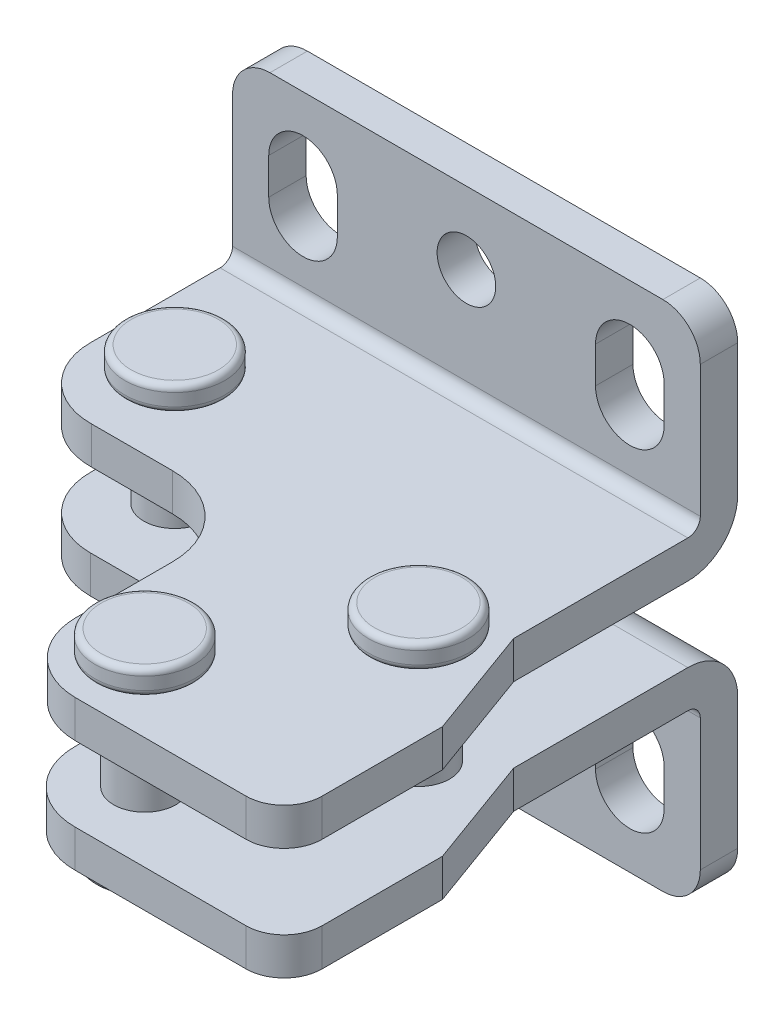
ISO-10303-21;
HEADER;
FILE_DESCRIPTION(('STEP AP214'),'2;1');
FILE_NAME('part.step','',(''),(''),'','','');
FILE_SCHEMA(('AUTOMOTIVE_DESIGN { 1 0 10303 214 1 1 1 1 }'));
ENDSEC;
DATA;
#1=APPLICATION_CONTEXT('core data for automotive mechanical design processes');
#2=APPLICATION_PROTOCOL_DEFINITION('international standard','automotive_design',2000,#1);
#3=PRODUCT_CONTEXT('',#1,'mechanical');
#4=PRODUCT('Part','Part','',(#3));
#5=PRODUCT_RELATED_PRODUCT_CATEGORY('part','',(#4));
#6=PRODUCT_DEFINITION_FORMATION('','',#4);
#7=PRODUCT_DEFINITION_CONTEXT('part definition',#1,'design');
#8=PRODUCT_DEFINITION('design','',#6,#7);
#9=PRODUCT_DEFINITION_SHAPE('','',#8);
#10=(LENGTH_UNIT() NAMED_UNIT(*) SI_UNIT(.MILLI.,.METRE.));
#11=(NAMED_UNIT(*) PLANE_ANGLE_UNIT() SI_UNIT($,.RADIAN.));
#12=(NAMED_UNIT(*) SI_UNIT($,.STERADIAN.) SOLID_ANGLE_UNIT());
#13=UNCERTAINTY_MEASURE_WITH_UNIT(LENGTH_MEASURE(1.E-05),#10,'distance_accuracy_value','');
#14=(GEOMETRIC_REPRESENTATION_CONTEXT(3) GLOBAL_UNCERTAINTY_ASSIGNED_CONTEXT((#13)) GLOBAL_UNIT_ASSIGNED_CONTEXT((#10,
#11,#12)) REPRESENTATION_CONTEXT('',''));
#15=CARTESIAN_POINT('',(0.,0.,0.));
#16=DIRECTION('',(0.,0.,1.));
#17=DIRECTION('',(1.,0.,0.));
#18=AXIS2_PLACEMENT_3D('',#15,#16,#17);
#19=CARTESIAN_POINT('',(-0.133000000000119,22.7547045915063,13.1465045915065));
#20=DIRECTION('',(0.,1.,0.));
#21=DIRECTION('',(0.,0.,1.));
#22=AXIS2_PLACEMENT_3D('',#19,#20,#21);
#23=PLANE('',#22);
#24=CARTESIAN_POINT('',(-0.133000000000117,22.7547045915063,13.1465045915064));
#25=DIRECTION('',(0.,1.,0.));
#26=DIRECTION('',(0.,0.,1.));
#27=AXIS2_PLACEMENT_3D('',#24,#25,#26);
#28=CIRCLE('',#27,3.5);
#29=CARTESIAN_POINT('',(-0.133000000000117,22.7547045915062,16.6465045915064));
#30=VERTEX_POINT('',#29);
#31=EDGE_CURVE('E18',#30,#30,#28,.F.);
#32=ORIENTED_EDGE('',*,*,#31,.F.);
#33=EDGE_LOOP('',(#32));
#34=FACE_BOUND('',#33,.T.);
#35=ADVANCED_FACE('F14',(#34),#23,.T.);
#36=CARTESIAN_POINT('',(18.3569999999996,22.7547045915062,34.0465045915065));
#37=DIRECTION('',(0.,1.,0.));
#38=DIRECTION('',(0.,0.,1.));
#39=AXIS2_PLACEMENT_3D('',#36,#37,#38);
#40=PLANE('',#39);
#41=CARTESIAN_POINT('',(18.3569999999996,22.7547045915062,34.0465045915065));
#42=DIRECTION('',(0.,1.,0.));
#43=DIRECTION('',(0.,0.,1.));
#44=AXIS2_PLACEMENT_3D('',#41,#42,#43);
#45=CIRCLE('',#44,3.5);
#46=CARTESIAN_POINT('',(18.3569999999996,22.7547045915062,37.5465045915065));
#47=VERTEX_POINT('',#46);
#48=EDGE_CURVE('E705',#47,#47,#45,.F.);
#49=ORIENTED_EDGE('',*,*,#48,.F.);
#50=EDGE_LOOP('',(#49));
#51=FACE_BOUND('',#50,.T.);
#52=ADVANCED_FACE('F715',(#51),#40,.T.);
#53=CARTESIAN_POINT('',(27.547,22.7547045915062,21.2965045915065));
#54=DIRECTION('',(0.,1.,0.));
#55=DIRECTION('',(0.,0.,1.));
#56=AXIS2_PLACEMENT_3D('',#53,#54,#55);
#57=PLANE('',#56);
#58=CARTESIAN_POINT('',(27.547,22.7547045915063,21.2965045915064));
#59=DIRECTION('',(0.,1.,0.));
#60=DIRECTION('',(0.,0.,1.));
#61=AXIS2_PLACEMENT_3D('',#58,#59,#60);
#62=CIRCLE('',#61,3.49999999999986);
#63=CARTESIAN_POINT('',(27.547,22.7547045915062,24.7965045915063));
#64=VERTEX_POINT('',#63);
#65=EDGE_CURVE('E521',#64,#64,#62,.F.);
#66=ORIENTED_EDGE('',*,*,#65,.F.);
#67=EDGE_LOOP('',(#66));
#68=FACE_BOUND('',#67,.T.);
#69=ADVANCED_FACE('F722',(#68),#57,.T.);
#70=CARTESIAN_POINT('',(-0.133000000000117,22.2547045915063,13.1465045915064));
#71=DIRECTION('',(0.,1.,0.));
#72=DIRECTION('',(0.,0.,1.));
#73=AXIS2_PLACEMENT_3D('',#70,#71,#72);
#74=TOROIDAL_SURFACE('',#73,3.5,0.5);
#75=CARTESIAN_POINT('',(-0.133000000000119,22.2547045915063,13.1465045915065));
#76=DIRECTION('',(0.,-1.,0.));
#77=DIRECTION('',(0.,0.,-1.));
#78=AXIS2_PLACEMENT_3D('',#75,#76,#77);
#79=CIRCLE('',#78,4.);
#80=CARTESIAN_POINT('',(-0.133000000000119,22.2547045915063,9.14650459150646));
#81=VERTEX_POINT('',#80);
#82=EDGE_CURVE('E519',#81,#81,#79,.T.);
#83=ORIENTED_EDGE('',*,*,#82,.F.);
#84=EDGE_LOOP('',(#83));
#85=FACE_BOUND('',#84,.T.);
#86=ORIENTED_EDGE('',*,*,#31,.T.);
#87=EDGE_LOOP('',(#86));
#88=FACE_BOUND('',#87,.T.);
#89=ADVANCED_FACE('F712',(#85,#88),#74,.T.);
#90=CARTESIAN_POINT('',(18.3569999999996,22.2547045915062,34.0465045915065));
#91=DIRECTION('',(0.,1.,0.));
#92=DIRECTION('',(0.,0.,1.));
#93=AXIS2_PLACEMENT_3D('',#90,#91,#92);
#94=TOROIDAL_SURFACE('',#93,3.5,0.5);
#95=CARTESIAN_POINT('',(18.3569999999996,22.2547045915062,34.0465045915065));
#96=DIRECTION('',(0.,-1.,0.));
#97=DIRECTION('',(0.,0.,-1.));
#98=AXIS2_PLACEMENT_3D('',#95,#96,#97);
#99=CIRCLE('',#98,4.);
#100=CARTESIAN_POINT('',(18.3569999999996,22.2547045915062,30.0465045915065));
#101=VERTEX_POINT('',#100);
#102=EDGE_CURVE('E516',#101,#101,#99,.T.);
#103=ORIENTED_EDGE('',*,*,#102,.F.);
#104=EDGE_LOOP('',(#103));
#105=FACE_BOUND('',#104,.T.);
#106=ORIENTED_EDGE('',*,*,#48,.T.);
#107=EDGE_LOOP('',(#106));
#108=FACE_BOUND('',#107,.T.);
#109=ADVANCED_FACE('F1019',(#105,#108),#94,.T.);
#110=CARTESIAN_POINT('',(27.547,22.2547045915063,21.2965045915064));
#111=DIRECTION('',(0.,1.,0.));
#112=DIRECTION('',(0.,0.,1.));
#113=AXIS2_PLACEMENT_3D('',#110,#111,#112);
#114=TOROIDAL_SURFACE('',#113,3.49999999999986,0.5);
#115=CARTESIAN_POINT('',(27.547,22.2547045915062,21.2965045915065));
#116=DIRECTION('',(0.,-1.,0.));
#117=DIRECTION('',(0.,0.,-1.));
#118=AXIS2_PLACEMENT_3D('',#115,#116,#117);
#119=CIRCLE('',#118,4.);
#120=CARTESIAN_POINT('',(27.547,22.2547045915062,17.2965045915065));
#121=VERTEX_POINT('',#120);
#122=EDGE_CURVE('E512',#121,#121,#119,.T.);
#123=ORIENTED_EDGE('',*,*,#122,.F.);
#124=EDGE_LOOP('',(#123));
#125=FACE_BOUND('',#124,.T.);
#126=ORIENTED_EDGE('',*,*,#65,.T.);
#127=EDGE_LOOP('',(#126));
#128=FACE_BOUND('',#127,.T.);
#129=ADVANCED_FACE('F1011',(#125,#128),#114,.T.);
#130=CARTESIAN_POINT('',(27.547,6.75470459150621,21.2965045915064));
#131=DIRECTION('',(0.,-1.,0.));
#132=DIRECTION('',(0.,0.,-1.));
#133=AXIS2_PLACEMENT_3D('',#130,#131,#132);
#134=PLANE('',#133);
#135=CARTESIAN_POINT('',(27.547,6.7547045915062,21.2965045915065));
#136=DIRECTION('',(0.,-1.,0.));
#137=DIRECTION('',(0.,0.,-1.));
#138=AXIS2_PLACEMENT_3D('',#135,#136,#137);
#139=CIRCLE('',#138,3.49999999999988);
#140=CARTESIAN_POINT('',(27.547,6.75470459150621,17.7965045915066));
#141=VERTEX_POINT('',#140);
#142=EDGE_CURVE('E515',#141,#141,#139,.F.);
#143=ORIENTED_EDGE('',*,*,#142,.F.);
#144=EDGE_LOOP('',(#143));
#145=FACE_BOUND('',#144,.T.);
#146=ADVANCED_FACE('F1007',(#145),#134,.T.);
#147=CARTESIAN_POINT('',(-0.133000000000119,6.75470459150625,13.1465045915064));
#148=DIRECTION('',(0.,-1.,0.));
#149=DIRECTION('',(0.,0.,-1.));
#150=AXIS2_PLACEMENT_3D('',#147,#148,#149);
#151=PLANE('',#150);
#152=CARTESIAN_POINT('',(-0.133000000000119,6.75470459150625,13.1465045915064));
#153=DIRECTION('',(0.,-1.,0.));
#154=DIRECTION('',(0.,0.,-1.));
#155=AXIS2_PLACEMENT_3D('',#152,#153,#154);
#156=CIRCLE('',#155,3.5);
#157=CARTESIAN_POINT('',(-0.133000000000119,6.75470459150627,9.64650459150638));
#158=VERTEX_POINT('',#157);
#159=EDGE_CURVE('E699',#158,#158,#156,.F.);
#160=ORIENTED_EDGE('',*,*,#159,.F.);
#161=EDGE_LOOP('',(#160));
#162=FACE_BOUND('',#161,.T.);
#163=ADVANCED_FACE('F1003',(#162),#151,.T.);
#164=CARTESIAN_POINT('',(18.3569999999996,6.75470459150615,34.0465045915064));
#165=DIRECTION('',(0.,-1.,0.));
#166=DIRECTION('',(0.,0.,-1.));
#167=AXIS2_PLACEMENT_3D('',#164,#165,#166);
#168=PLANE('',#167);
#169=CARTESIAN_POINT('',(18.3569999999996,6.75470459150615,34.0465045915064));
#170=DIRECTION('',(0.,-1.,0.));
#171=DIRECTION('',(0.,0.,-1.));
#172=AXIS2_PLACEMENT_3D('',#169,#170,#171);
#173=CIRCLE('',#172,3.5);
#174=CARTESIAN_POINT('',(18.3569999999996,6.75470459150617,30.5465045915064));
#175=VERTEX_POINT('',#174);
#176=EDGE_CURVE('E492',#175,#175,#173,.F.);
#177=ORIENTED_EDGE('',*,*,#176,.F.);
#178=EDGE_LOOP('',(#177));
#179=FACE_BOUND('',#178,.T.);
#180=ADVANCED_FACE('F999',(#179),#168,.T.);
#181=CARTESIAN_POINT('',(-0.133000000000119,22.7547045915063,13.1465045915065));
#182=DIRECTION('',(0.,-1.,0.));
#183=DIRECTION('',(0.,0.,-1.));
#184=AXIS2_PLACEMENT_3D('',#181,#182,#183);
#185=CYLINDRICAL_SURFACE('',#184,4.);
#186=ORIENTED_EDGE('',*,*,#82,.T.);
#187=EDGE_LOOP('',(#186));
#188=FACE_BOUND('',#187,.T.);
#189=CARTESIAN_POINT('',(-0.133000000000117,21.2547045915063,13.1465045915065));
#190=DIRECTION('',(0.,-1.,0.));
#191=DIRECTION('',(0.,0.,-1.));
#192=AXIS2_PLACEMENT_3D('',#189,#190,#191);
#193=CIRCLE('',#192,4.);
#194=CARTESIAN_POINT('',(-0.133000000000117,21.2547045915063,9.14650459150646));
#195=VERTEX_POINT('',#194);
#196=EDGE_CURVE('E318',#195,#195,#193,.T.);
#197=ORIENTED_EDGE('',*,*,#196,.F.);
#198=EDGE_LOOP('',(#197));
#199=FACE_BOUND('',#198,.T.);
#200=ADVANCED_FACE('F995',(#188,#199),#185,.T.);
#201=CARTESIAN_POINT('',(18.3569999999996,22.7547045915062,34.0465045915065));
#202=DIRECTION('',(0.,-1.,0.));
#203=DIRECTION('',(0.,0.,-1.));
#204=AXIS2_PLACEMENT_3D('',#201,#202,#203);
#205=CYLINDRICAL_SURFACE('',#204,4.);
#206=ORIENTED_EDGE('',*,*,#102,.T.);
#207=EDGE_LOOP('',(#206));
#208=FACE_BOUND('',#207,.T.);
#209=CARTESIAN_POINT('',(18.3569999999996,21.2547045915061,34.0465045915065));
#210=DIRECTION('',(0.,-1.,0.));
#211=DIRECTION('',(0.,0.,-1.));
#212=AXIS2_PLACEMENT_3D('',#209,#210,#211);
#213=CIRCLE('',#212,4.);
#214=CARTESIAN_POINT('',(18.3569999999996,21.2547045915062,30.0465045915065));
#215=VERTEX_POINT('',#214);
#216=EDGE_CURVE('E507',#215,#215,#213,.T.);
#217=ORIENTED_EDGE('',*,*,#216,.F.);
#218=EDGE_LOOP('',(#217));
#219=FACE_BOUND('',#218,.T.);
#220=ADVANCED_FACE('F991',(#208,#219),#205,.T.);
#221=CARTESIAN_POINT('',(27.547,22.7547045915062,21.2965045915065));
#222=DIRECTION('',(0.,-1.,0.));
#223=DIRECTION('',(0.,0.,-1.));
#224=AXIS2_PLACEMENT_3D('',#221,#222,#223);
#225=CYLINDRICAL_SURFACE('',#224,4.);
#226=ORIENTED_EDGE('',*,*,#122,.T.);
#227=EDGE_LOOP('',(#226));
#228=FACE_BOUND('',#227,.T.);
#229=CARTESIAN_POINT('',(27.547,21.2547045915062,21.2965045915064));
#230=DIRECTION('',(0.,-1.,0.));
#231=DIRECTION('',(0.,0.,-1.));
#232=AXIS2_PLACEMENT_3D('',#229,#230,#231);
#233=CIRCLE('',#232,3.99999999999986);
#234=CARTESIAN_POINT('',(27.547,21.2547045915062,17.2965045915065));
#235=VERTEX_POINT('',#234);
#236=EDGE_CURVE('E504',#235,#235,#233,.T.);
#237=ORIENTED_EDGE('',*,*,#236,.F.);
#238=EDGE_LOOP('',(#237));
#239=FACE_BOUND('',#238,.T.);
#240=ADVANCED_FACE('F987',(#228,#239),#225,.T.);
#241=CARTESIAN_POINT('',(27.547,7.25470459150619,21.2965045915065));
#242=DIRECTION('',(0.,-1.,0.));
#243=DIRECTION('',(0.,0.,-1.));
#244=AXIS2_PLACEMENT_3D('',#241,#242,#243);
#245=TOROIDAL_SURFACE('',#244,3.5000000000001,0.49999999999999);
#246=ORIENTED_EDGE('',*,*,#142,.T.);
#247=EDGE_LOOP('',(#246));
#248=FACE_BOUND('',#247,.T.);
#249=CARTESIAN_POINT('',(27.547,7.25470459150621,21.2965045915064));
#250=DIRECTION('',(0.,1.,0.));
#251=DIRECTION('',(0.,0.,1.));
#252=AXIS2_PLACEMENT_3D('',#249,#250,#251);
#253=CIRCLE('',#252,4.);
#254=CARTESIAN_POINT('',(27.547,7.25470459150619,25.2965045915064));
#255=VERTEX_POINT('',#254);
#256=EDGE_CURVE('E501',#255,#255,#253,.T.);
#257=ORIENTED_EDGE('',*,*,#256,.F.);
#258=EDGE_LOOP('',(#257));
#259=FACE_BOUND('',#258,.T.);
#260=ADVANCED_FACE('F990',(#248,#259),#245,.T.);
#261=CARTESIAN_POINT('',(-0.13300000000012,7.25470459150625,13.1465045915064));
#262=DIRECTION('',(0.,-1.,0.));
#263=DIRECTION('',(0.,0.,-1.));
#264=AXIS2_PLACEMENT_3D('',#261,#262,#263);
#265=TOROIDAL_SURFACE('',#264,3.5,0.5);
#266=ORIENTED_EDGE('',*,*,#159,.T.);
#267=EDGE_LOOP('',(#266));
#268=FACE_BOUND('',#267,.T.);
#269=CARTESIAN_POINT('',(-0.133000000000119,7.25470459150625,13.1465045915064));
#270=DIRECTION('',(0.,1.,0.));
#271=DIRECTION('',(0.,0.,1.));
#272=AXIS2_PLACEMENT_3D('',#269,#270,#271);
#273=CIRCLE('',#272,4.);
#274=CARTESIAN_POINT('',(-0.133000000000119,7.25470459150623,17.1465045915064));
#275=VERTEX_POINT('',#274);
#276=EDGE_CURVE('E498',#275,#275,#273,.T.);
#277=ORIENTED_EDGE('',*,*,#276,.F.);
#278=EDGE_LOOP('',(#277));
#279=FACE_BOUND('',#278,.T.);
#280=ADVANCED_FACE('F1036',(#268,#279),#265,.T.);
#281=CARTESIAN_POINT('',(18.3569999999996,7.25470459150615,34.0465045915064));
#282=DIRECTION('',(0.,-1.,0.));
#283=DIRECTION('',(0.,0.,-1.));
#284=AXIS2_PLACEMENT_3D('',#281,#282,#283);
#285=TOROIDAL_SURFACE('',#284,3.5,0.5);
#286=ORIENTED_EDGE('',*,*,#176,.T.);
#287=EDGE_LOOP('',(#286));
#288=FACE_BOUND('',#287,.T.);
#289=CARTESIAN_POINT('',(18.3569999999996,7.25470459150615,34.0465045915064));
#290=DIRECTION('',(0.,1.,0.));
#291=DIRECTION('',(0.,0.,1.));
#292=AXIS2_PLACEMENT_3D('',#289,#290,#291);
#293=CIRCLE('',#292,4.);
#294=CARTESIAN_POINT('',(18.3569999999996,7.25470459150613,38.0465045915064));
#295=VERTEX_POINT('',#294);
#296=EDGE_CURVE('E495',#295,#295,#293,.T.);
#297=ORIENTED_EDGE('',*,*,#296,.F.);
#298=EDGE_LOOP('',(#297));
#299=FACE_BOUND('',#298,.T.);
#300=ADVANCED_FACE('F985',(#288,#299),#285,.T.);
#301=CARTESIAN_POINT('',(31.85,35.3047045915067,-37.6202312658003));
#302=DIRECTION('',(0.,1.,0.));
#303=DIRECTION('',(0.,0.,1.));
#304=AXIS2_PLACEMENT_3D('',#301,#302,#303);
#305=PLANE('',#304);
#306=DIRECTION('',(1.,0.,0.));
#307=VECTOR('',#306,1.);
#308=CARTESIAN_POINT('',(6.50533841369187,35.3047045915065,1.83535626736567E-13));
#309=LINE('',#308,#307);
#310=CARTESIAN_POINT('',(-2.65,35.3047045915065,1.7949066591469E-13));
#311=VERTEX_POINT('',#310);
#312=CARTESIAN_POINT('',(28.85,35.3047045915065,1.63845103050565E-13));
#313=VERTEX_POINT('',#312);
#314=EDGE_CURVE('E452',#311,#313,#309,.T.);
#315=ORIENTED_EDGE('',*,*,#314,.F.);
#316=DIRECTION('',(0.,0.,1.));
#317=VECTOR('',#316,1.);
#318=CARTESIAN_POINT('',(-2.65,35.3047045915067,-37.6202312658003));
#319=LINE('',#318,#317);
#320=CARTESIAN_POINT('',(-2.65,35.3047045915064,3.00000000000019));
#321=VERTEX_POINT('',#320);
#322=EDGE_CURVE('E455',#321,#311,#319,.F.);
#323=ORIENTED_EDGE('',*,*,#322,.F.);
#324=DIRECTION('',(1.,0.,0.));
#325=VECTOR('',#324,1.);
#326=CARTESIAN_POINT('',(6.50533841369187,35.3047045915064,3.00000000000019));
#327=LINE('',#326,#325);
#328=CARTESIAN_POINT('',(28.85,35.3047045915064,3.00000000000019));
#329=VERTEX_POINT('',#328);
#330=EDGE_CURVE('E427',#321,#329,#327,.T.);
#331=ORIENTED_EDGE('',*,*,#330,.T.);
#332=DIRECTION('',(0.,0.,1.));
#333=VECTOR('',#332,1.);
#334=CARTESIAN_POINT('',(28.85,35.3047045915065,-10.4716954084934));
#335=LINE('',#334,#333);
#336=EDGE_CURVE('E436',#313,#329,#335,.T.);
#337=ORIENTED_EDGE('',*,*,#336,.F.);
#338=EDGE_LOOP('',(#315,#323,#331,#337));
#339=FACE_BOUND('',#338,.T.);
#340=ADVANCED_FACE('F981',(#339),#305,.T.);
#341=CARTESIAN_POINT('',(13.1,29.5094091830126,3.00000000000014));
#342=DIRECTION('',(0.,0.,-1.));
#343=DIRECTION('',(0.,1.,0.));
#344=AXIS2_PLACEMENT_3D('',#341,#342,#343);
#345=CYLINDRICAL_SURFACE('',#344,2.35);
#346=CARTESIAN_POINT('',(13.1,29.5094091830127,1.37910516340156E-13));
#347=DIRECTION('',(0.,0.,-1.));
#348=DIRECTION('',(0.,1.,0.));
#349=AXIS2_PLACEMENT_3D('',#346,#347,#348);
#350=CIRCLE('',#349,2.35);
#351=CARTESIAN_POINT('',(13.1,31.8594091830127,1.56986431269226E-13));
#352=VERTEX_POINT('',#351);
#353=EDGE_CURVE('E691',#352,#352,#350,.F.);
#354=ORIENTED_EDGE('',*,*,#353,.F.);
#355=EDGE_LOOP('',(#354));
#356=FACE_BOUND('',#355,.T.);
#357=CARTESIAN_POINT('',(13.1,29.5094091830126,3.00000000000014));
#358=DIRECTION('',(0.,0.,-1.));
#359=DIRECTION('',(0.,1.,0.));
#360=AXIS2_PLACEMENT_3D('',#357,#358,#359);
#361=CIRCLE('',#360,2.35);
#362=CARTESIAN_POINT('',(13.1,31.8594091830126,3.00000000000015));
#363=VERTEX_POINT('',#362);
#364=EDGE_CURVE('E426',#363,#363,#361,.F.);
#365=ORIENTED_EDGE('',*,*,#364,.T.);
#366=EDGE_LOOP('',(#365));
#367=FACE_BOUND('',#366,.T.);
#368=ADVANCED_FACE('F977',(#356,#367),#345,.F.);
#369=CARTESIAN_POINT('',(2.75,26.6094091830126,3.00000000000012));
#370=DIRECTION('',(1.,0.,0.));
#371=DIRECTION('',(0.,0.,-1.));
#372=AXIS2_PLACEMENT_3D('',#369,#370,#371);
#373=PLANE('',#372);
#374=DIRECTION('',(0.,1.,0.));
#375=VECTOR('',#374,1.);
#376=CARTESIAN_POINT('',(2.75,-4.50859082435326,2.99999999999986));
#377=LINE('',#376,#375);
#378=CARTESIAN_POINT('',(2.75,26.6094091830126,3.00000000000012));
#379=VERTEX_POINT('',#378);
#380=CARTESIAN_POINT('',(2.75,29.5094091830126,3.00000000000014));
#381=VERTEX_POINT('',#380);
#382=EDGE_CURVE('E423',#379,#381,#377,.T.);
#383=ORIENTED_EDGE('',*,*,#382,.T.);
#384=DIRECTION('',(0.,0.,-1.));
#385=VECTOR('',#384,1.);
#386=CARTESIAN_POINT('',(2.75,29.5094091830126,3.00000000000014));
#387=LINE('',#386,#385);
#388=CARTESIAN_POINT('',(2.75,29.5094091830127,1.37230835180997E-13));
#389=VERTEX_POINT('',#388);
#390=EDGE_CURVE('E489',#381,#389,#387,.T.);
#391=ORIENTED_EDGE('',*,*,#390,.T.);
#392=DIRECTION('',(0.,1.,0.));
#393=VECTOR('',#392,1.);
#394=CARTESIAN_POINT('',(2.75,-4.50859082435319,-1.39645239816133E-13));
#395=LINE('',#394,#393);
#396=CARTESIAN_POINT('',(2.75,26.6094091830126,1.1887738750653E-13));
#397=VERTEX_POINT('',#396);
#398=EDGE_CURVE('E445',#397,#389,#395,.T.);
#399=ORIENTED_EDGE('',*,*,#398,.F.);
#400=DIRECTION('',(0.,0.,-1.));
#401=VECTOR('',#400,1.);
#402=CARTESIAN_POINT('',(2.75,26.6094091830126,3.00000000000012));
#403=LINE('',#402,#401);
#404=EDGE_CURVE('E481',#397,#379,#403,.F.);
#405=ORIENTED_EDGE('',*,*,#404,.T.);
#406=EDGE_LOOP('',(#383,#391,#399,#405));
#407=FACE_BOUND('',#406,.T.);
#408=ADVANCED_FACE('F973',(#407),#373,.F.);
#409=CARTESIAN_POINT('',(0.,29.5094091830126,3.00000000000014));
#410=DIRECTION('',(0.,0.,-1.));
#411=DIRECTION('',(0.,1.,0.));
#412=AXIS2_PLACEMENT_3D('',#409,#410,#411);
#413=CYLINDRICAL_SURFACE('',#412,2.75);
#414=CARTESIAN_POINT('',(0.,29.5094091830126,3.00000000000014));
#415=DIRECTION('',(0.,0.,-1.));
#416=DIRECTION('',(0.,1.,0.));
#417=AXIS2_PLACEMENT_3D('',#414,#415,#416);
#418=CIRCLE('',#417,2.75);
#419=CARTESIAN_POINT('',(-2.75,29.5094091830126,3.00000000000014));
#420=VERTEX_POINT('',#419);
#421=EDGE_CURVE('E422',#381,#420,#418,.F.);
#422=ORIENTED_EDGE('',*,*,#421,.T.);
#423=DIRECTION('',(0.,0.,1.));
#424=VECTOR('',#423,1.);
#425=CARTESIAN_POINT('',(-2.75,29.5094091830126,3.00000000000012));
#426=LINE('',#425,#424);
#427=CARTESIAN_POINT('',(-2.75,29.5094091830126,1.37910516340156E-13));
#428=VERTEX_POINT('',#427);
#429=EDGE_CURVE('E484',#420,#428,#426,.F.);
#430=ORIENTED_EDGE('',*,*,#429,.T.);
#431=CARTESIAN_POINT('',(0.,29.5094091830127,1.37910516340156E-13));
#432=DIRECTION('',(0.,0.,-1.));
#433=DIRECTION('',(0.,1.,0.));
#434=AXIS2_PLACEMENT_3D('',#431,#432,#433);
#435=CIRCLE('',#434,2.75);
#436=EDGE_CURVE('E451',#389,#428,#435,.F.);
#437=ORIENTED_EDGE('',*,*,#436,.F.);
#438=ORIENTED_EDGE('',*,*,#390,.F.);
#439=EDGE_LOOP('',(#422,#430,#437,#438));
#440=FACE_BOUND('',#439,.T.);
#441=ADVANCED_FACE('F969',(#440),#413,.F.);
#442=CARTESIAN_POINT('',(-2.75,26.6094091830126,3.00000000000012));
#443=DIRECTION('',(-1.,0.,0.));
#444=DIRECTION('',(0.,0.,1.));
#445=AXIS2_PLACEMENT_3D('',#442,#443,#444);
#446=PLANE('',#445);
#447=DIRECTION('',(0.,1.,0.));
#448=VECTOR('',#447,1.);
#449=CARTESIAN_POINT('',(-2.75,-4.50859082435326,2.99999999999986));
#450=LINE('',#449,#448);
#451=CARTESIAN_POINT('',(-2.75,26.6094091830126,3.00000000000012));
#452=VERTEX_POINT('',#451);
#453=EDGE_CURVE('E419',#420,#452,#450,.F.);
#454=ORIENTED_EDGE('',*,*,#453,.T.);
#455=DIRECTION('',(0.,0.,-1.));
#456=VECTOR('',#455,1.);
#457=CARTESIAN_POINT('',(-2.75,26.6094091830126,3.00000000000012));
#458=LINE('',#457,#456);
#459=CARTESIAN_POINT('',(-2.75,26.6094091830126,1.1887738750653E-13));
#460=VERTEX_POINT('',#459);
#461=EDGE_CURVE('E480',#452,#460,#458,.T.);
#462=ORIENTED_EDGE('',*,*,#461,.T.);
#463=DIRECTION('',(0.,1.,0.));
#464=VECTOR('',#463,1.);
#465=CARTESIAN_POINT('',(-2.75,-4.50859082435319,-1.39645239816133E-13));
#466=LINE('',#465,#464);
#467=EDGE_CURVE('E449',#428,#460,#466,.F.);
#468=ORIENTED_EDGE('',*,*,#467,.F.);
#469=ORIENTED_EDGE('',*,*,#429,.F.);
#470=EDGE_LOOP('',(#454,#462,#468,#469));
#471=FACE_BOUND('',#470,.T.);
#472=ADVANCED_FACE('F965',(#471),#446,.F.);
#473=CARTESIAN_POINT('',(0.,26.6094091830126,3.00000000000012));
#474=DIRECTION('',(0.,0.,-1.));
#475=DIRECTION('',(0.,1.,0.));
#476=AXIS2_PLACEMENT_3D('',#473,#474,#475);
#477=CYLINDRICAL_SURFACE('',#476,2.75);
#478=CARTESIAN_POINT('',(0.,26.6094091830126,3.00000000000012));
#479=DIRECTION('',(0.,0.,-1.));
#480=DIRECTION('',(0.,1.,0.));
#481=AXIS2_PLACEMENT_3D('',#478,#479,#480);
#482=CIRCLE('',#481,2.75);
#483=EDGE_CURVE('E418',#452,#379,#482,.F.);
#484=ORIENTED_EDGE('',*,*,#483,.T.);
#485=ORIENTED_EDGE('',*,*,#404,.F.);
#486=CARTESIAN_POINT('',(0.,26.6094091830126,1.2490009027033E-13));
#487=DIRECTION('',(0.,0.,-1.));
#488=DIRECTION('',(0.,1.,0.));
#489=AXIS2_PLACEMENT_3D('',#486,#487,#488);
#490=CIRCLE('',#489,2.75);
#491=EDGE_CURVE('E448',#460,#397,#490,.F.);
#492=ORIENTED_EDGE('',*,*,#491,.F.);
#493=ORIENTED_EDGE('',*,*,#461,.F.);
#494=EDGE_LOOP('',(#484,#485,#492,#493));
#495=FACE_BOUND('',#494,.T.);
#496=ADVANCED_FACE('F961',(#495),#477,.F.);
#497=CARTESIAN_POINT('',(28.95,26.6094091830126,3.00000000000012));
#498=DIRECTION('',(1.,0.,0.));
#499=DIRECTION('',(0.,0.,-1.));
#500=AXIS2_PLACEMENT_3D('',#497,#498,#499);
#501=PLANE('',#500);
#502=DIRECTION('',(0.,1.,0.));
#503=VECTOR('',#502,1.);
#504=CARTESIAN_POINT('',(28.95,-4.50859082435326,2.99999999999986));
#505=LINE('',#504,#503);
#506=CARTESIAN_POINT('',(28.95,26.6094091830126,3.00000000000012));
#507=VERTEX_POINT('',#506);
#508=CARTESIAN_POINT('',(28.95,29.5094091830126,3.00000000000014));
#509=VERTEX_POINT('',#508);
#510=EDGE_CURVE('E415',#507,#509,#505,.T.);
#511=ORIENTED_EDGE('',*,*,#510,.T.);
#512=DIRECTION('',(0.,0.,-1.));
#513=VECTOR('',#512,1.);
#514=CARTESIAN_POINT('',(28.95,29.5094091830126,3.00000000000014));
#515=LINE('',#514,#513);
#516=CARTESIAN_POINT('',(28.95,29.5094091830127,1.37230835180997E-13));
#517=VERTEX_POINT('',#516);
#518=EDGE_CURVE('E477',#509,#517,#515,.T.);
#519=ORIENTED_EDGE('',*,*,#518,.T.);
#520=DIRECTION('',(0.,1.,0.));
#521=VECTOR('',#520,1.);
#522=CARTESIAN_POINT('',(28.95,-4.50859082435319,-1.39645239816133E-13));
#523=LINE('',#522,#521);
#524=CARTESIAN_POINT('',(28.95,26.6094091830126,1.1887738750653E-13));
#525=VERTEX_POINT('',#524);
#526=EDGE_CURVE('E437',#525,#517,#523,.T.);
#527=ORIENTED_EDGE('',*,*,#526,.F.);
#528=DIRECTION('',(0.,0.,-1.));
#529=VECTOR('',#528,1.);
#530=CARTESIAN_POINT('',(28.95,26.6094091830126,3.00000000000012));
#531=LINE('',#530,#529);
#532=EDGE_CURVE('E468',#525,#507,#531,.F.);
#533=ORIENTED_EDGE('',*,*,#532,.T.);
#534=EDGE_LOOP('',(#511,#519,#527,#533));
#535=FACE_BOUND('',#534,.T.);
#536=ADVANCED_FACE('F957',(#535),#501,.F.);
#537=CARTESIAN_POINT('',(26.2,29.5094091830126,3.00000000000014));
#538=DIRECTION('',(0.,0.,-1.));
#539=DIRECTION('',(0.,1.,0.));
#540=AXIS2_PLACEMENT_3D('',#537,#538,#539);
#541=CYLINDRICAL_SURFACE('',#540,2.75);
#542=CARTESIAN_POINT('',(26.2,29.5094091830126,3.00000000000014));
#543=DIRECTION('',(0.,0.,-1.));
#544=DIRECTION('',(0.,1.,0.));
#545=AXIS2_PLACEMENT_3D('',#542,#543,#544);
#546=CIRCLE('',#545,2.75);
#547=CARTESIAN_POINT('',(23.45,29.5094091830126,3.00000000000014));
#548=VERTEX_POINT('',#547);
#549=EDGE_CURVE('E414',#509,#548,#546,.F.);
#550=ORIENTED_EDGE('',*,*,#549,.T.);
#551=DIRECTION('',(0.,0.,1.));
#552=VECTOR('',#551,1.);
#553=CARTESIAN_POINT('',(23.45,29.5094091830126,3.00000000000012));
#554=LINE('',#553,#552);
#555=CARTESIAN_POINT('',(23.45,29.5094091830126,1.37910516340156E-13));
#556=VERTEX_POINT('',#555);
#557=EDGE_CURVE('E472',#548,#556,#554,.F.);
#558=ORIENTED_EDGE('',*,*,#557,.T.);
#559=CARTESIAN_POINT('',(26.2,29.5094091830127,1.37910516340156E-13));
#560=DIRECTION('',(0.,0.,-1.));
#561=DIRECTION('',(0.,1.,0.));
#562=AXIS2_PLACEMENT_3D('',#559,#560,#561);
#563=CIRCLE('',#562,2.75);
#564=EDGE_CURVE('E444',#517,#556,#563,.F.);
#565=ORIENTED_EDGE('',*,*,#564,.F.);
#566=ORIENTED_EDGE('',*,*,#518,.F.);
#567=EDGE_LOOP('',(#550,#558,#565,#566));
#568=FACE_BOUND('',#567,.T.);
#569=ADVANCED_FACE('F953',(#568),#541,.F.);
#570=CARTESIAN_POINT('',(23.45,26.6094091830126,3.00000000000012));
#571=DIRECTION('',(-1.,0.,0.));
#572=DIRECTION('',(0.,0.,1.));
#573=AXIS2_PLACEMENT_3D('',#570,#571,#572);
#574=PLANE('',#573);
#575=DIRECTION('',(0.,1.,0.));
#576=VECTOR('',#575,1.);
#577=CARTESIAN_POINT('',(23.45,-4.50859082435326,2.99999999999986));
#578=LINE('',#577,#576);
#579=CARTESIAN_POINT('',(23.45,26.6094091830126,3.00000000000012));
#580=VERTEX_POINT('',#579);
#581=EDGE_CURVE('E410',#548,#580,#578,.F.);
#582=ORIENTED_EDGE('',*,*,#581,.T.);
#583=DIRECTION('',(0.,0.,-1.));
#584=VECTOR('',#583,1.);
#585=CARTESIAN_POINT('',(23.45,26.6094091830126,3.00000000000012));
#586=LINE('',#585,#584);
#587=CARTESIAN_POINT('',(23.45,26.6094091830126,1.1887738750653E-13));
#588=VERTEX_POINT('',#587);
#589=EDGE_CURVE('E471',#580,#588,#586,.T.);
#590=ORIENTED_EDGE('',*,*,#589,.T.);
#591=DIRECTION('',(0.,1.,0.));
#592=VECTOR('',#591,1.);
#593=CARTESIAN_POINT('',(23.45,-4.50859082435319,-1.39645239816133E-13));
#594=LINE('',#593,#592);
#595=EDGE_CURVE('E442',#556,#588,#594,.F.);
#596=ORIENTED_EDGE('',*,*,#595,.F.);
#597=ORIENTED_EDGE('',*,*,#557,.F.);
#598=EDGE_LOOP('',(#582,#590,#596,#597));
#599=FACE_BOUND('',#598,.T.);
#600=ADVANCED_FACE('F949',(#599),#574,.F.);
#601=CARTESIAN_POINT('',(26.2,26.6094091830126,3.00000000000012));
#602=DIRECTION('',(0.,0.,-1.));
#603=DIRECTION('',(0.,1.,0.));
#604=AXIS2_PLACEMENT_3D('',#601,#602,#603);
#605=CYLINDRICAL_SURFACE('',#604,2.75);
#606=CARTESIAN_POINT('',(26.2,26.6094091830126,3.00000000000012));
#607=DIRECTION('',(0.,0.,-1.));
#608=DIRECTION('',(0.,1.,0.));
#609=AXIS2_PLACEMENT_3D('',#606,#607,#608);
#610=CIRCLE('',#609,2.75);
#611=EDGE_CURVE('E413',#580,#507,#610,.F.);
#612=ORIENTED_EDGE('',*,*,#611,.T.);
#613=ORIENTED_EDGE('',*,*,#532,.F.);
#614=CARTESIAN_POINT('',(26.2,26.6094091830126,1.2490009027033E-13));
#615=DIRECTION('',(0.,0.,-1.));
#616=DIRECTION('',(0.,1.,0.));
#617=AXIS2_PLACEMENT_3D('',#614,#615,#616);
#618=CIRCLE('',#617,2.75);
#619=EDGE_CURVE('E441',#588,#525,#618,.F.);
#620=ORIENTED_EDGE('',*,*,#619,.F.);
#621=ORIENTED_EDGE('',*,*,#589,.F.);
#622=EDGE_LOOP('',(#612,#613,#620,#621));
#623=FACE_BOUND('',#622,.T.);
#624=ADVANCED_FACE('F946',(#623),#605,.F.);
#625=CARTESIAN_POINT('',(-0.133000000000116,21.2547045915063,13.1465045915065));
#626=DIRECTION('',(0.,1.,0.));
#627=DIRECTION('',(0.,0.,1.));
#628=AXIS2_PLACEMENT_3D('',#625,#626,#627);
#629=TOROIDAL_SURFACE('',#628,3.5,0.5);
#630=CARTESIAN_POINT('',(-0.133000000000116,20.7547045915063,13.1465045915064));
#631=DIRECTION('',(0.,1.,0.));
#632=DIRECTION('',(0.,0.,1.));
#633=AXIS2_PLACEMENT_3D('',#630,#631,#632);
#634=CIRCLE('',#633,3.5);
#635=CARTESIAN_POINT('',(-0.133000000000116,20.7547045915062,16.6465045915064));
#636=VERTEX_POINT('',#635);
#637=EDGE_CURVE('E330',#636,#636,#634,.T.);
#638=ORIENTED_EDGE('',*,*,#637,.T.);
#639=EDGE_LOOP('',(#638));
#640=FACE_BOUND('',#639,.T.);
#641=ORIENTED_EDGE('',*,*,#196,.T.);
#642=EDGE_LOOP('',(#641));
#643=FACE_BOUND('',#642,.T.);
#644=ADVANCED_FACE('F945',(#640,#643),#629,.T.);
#645=CARTESIAN_POINT('',(50.9242152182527,21.7547045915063,4.00000000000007));
#646=DIRECTION('',(-1.,0.,0.));
#647=DIRECTION('',(0.,0.,1.));
#648=AXIS2_PLACEMENT_3D('',#645,#646,#647);
#649=CYLINDRICAL_SURFACE('',#648,1.);
#650=CARTESIAN_POINT('',(31.85,21.7547045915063,4.00000000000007));
#651=DIRECTION('',(-1.,0.,0.));
#652=DIRECTION('',(0.,0.,1.));
#653=AXIS2_PLACEMENT_3D('',#650,#651,#652);
#654=CIRCLE('',#653,1.);
#655=CARTESIAN_POINT('',(31.85,21.7547045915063,3.00000000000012));
#656=VERTEX_POINT('',#655);
#657=CARTESIAN_POINT('',(31.85,20.7547045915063,4.00000000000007));
#658=VERTEX_POINT('',#657);
#659=EDGE_CURVE('E317',#656,#658,#654,.T.);
#660=ORIENTED_EDGE('',*,*,#659,.F.);
#661=DIRECTION('',(1.,0.,0.));
#662=VECTOR('',#661,1.);
#663=CARTESIAN_POINT('',(6.50533841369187,21.7547045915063,3.00000000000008));
#664=LINE('',#663,#662);
#665=CARTESIAN_POINT('',(-5.65,21.7547045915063,3.00000000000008));
#666=VERTEX_POINT('',#665);
#667=EDGE_CURVE('E312',#656,#666,#664,.F.);
#668=ORIENTED_EDGE('',*,*,#667,.T.);
#669=CARTESIAN_POINT('',(-5.65,21.7547045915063,4.00000000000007));
#670=DIRECTION('',(-1.,0.,0.));
#671=DIRECTION('',(0.,0.,1.));
#672=AXIS2_PLACEMENT_3D('',#669,#670,#671);
#673=CIRCLE('',#672,1.);
#674=CARTESIAN_POINT('',(-5.65,20.7547045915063,4.00000000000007));
#675=VERTEX_POINT('',#674);
#676=EDGE_CURVE('E306',#675,#666,#673,.F.);
#677=ORIENTED_EDGE('',*,*,#676,.F.);
#678=DIRECTION('',(1.,0.,0.));
#679=VECTOR('',#678,1.);
#680=CARTESIAN_POINT('',(6.50533841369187,20.7547045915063,4.00000000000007));
#681=LINE('',#680,#679);
#682=EDGE_CURVE('E309',#675,#658,#681,.T.);
#683=ORIENTED_EDGE('',*,*,#682,.T.);
#684=EDGE_LOOP('',(#660,#668,#677,#683));
#685=FACE_BOUND('',#684,.T.);
#686=ADVANCED_FACE('F308',(#685),#649,.F.);
#687=CARTESIAN_POINT('',(18.3569999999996,21.2547045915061,34.0465045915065));
#688=DIRECTION('',(0.,1.,0.));
#689=DIRECTION('',(0.,0.,1.));
#690=AXIS2_PLACEMENT_3D('',#687,#688,#689);
#691=TOROIDAL_SURFACE('',#690,3.5,0.5);
#692=CARTESIAN_POINT('',(18.3569999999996,20.7547045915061,34.0465045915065));
#693=DIRECTION('',(0.,1.,0.));
#694=DIRECTION('',(0.,0.,1.));
#695=AXIS2_PLACEMENT_3D('',#692,#693,#694);
#696=CIRCLE('',#695,3.5);
#697=CARTESIAN_POINT('',(18.3569999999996,20.7547045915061,37.5465045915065));
#698=VERTEX_POINT('',#697);
#699=EDGE_CURVE('E329',#698,#698,#696,.T.);
#700=ORIENTED_EDGE('',*,*,#699,.T.);
#701=EDGE_LOOP('',(#700));
#702=FACE_BOUND('',#701,.T.);
#703=ORIENTED_EDGE('',*,*,#216,.T.);
#704=EDGE_LOOP('',(#703));
#705=FACE_BOUND('',#704,.T.);
#706=ADVANCED_FACE('F944',(#702,#705),#691,.T.);
#707=CARTESIAN_POINT('',(27.547,21.2547045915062,21.2965045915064));
#708=DIRECTION('',(0.,1.,0.));
#709=DIRECTION('',(0.,0.,1.));
#710=AXIS2_PLACEMENT_3D('',#707,#708,#709);
#711=TOROIDAL_SURFACE('',#710,3.49999999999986,0.5);
#712=CARTESIAN_POINT('',(27.547,20.7547045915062,21.2965045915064));
#713=DIRECTION('',(0.,1.,0.));
#714=DIRECTION('',(0.,0.,1.));
#715=AXIS2_PLACEMENT_3D('',#712,#713,#714);
#716=CIRCLE('',#715,3.50000000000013);
#717=CARTESIAN_POINT('',(27.547,20.7547045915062,24.7965045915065));
#718=VERTEX_POINT('',#717);
#719=EDGE_CURVE('E467',#718,#718,#716,.T.);
#720=ORIENTED_EDGE('',*,*,#719,.T.);
#721=EDGE_LOOP('',(#720));
#722=FACE_BOUND('',#721,.T.);
#723=ORIENTED_EDGE('',*,*,#236,.T.);
#724=EDGE_LOOP('',(#723));
#725=FACE_BOUND('',#724,.T.);
#726=ADVANCED_FACE('F940',(#722,#725),#711,.T.);
#727=CARTESIAN_POINT('',(27.547,6.75470459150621,21.2965045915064));
#728=DIRECTION('',(0.,1.,0.));
#729=DIRECTION('',(0.,0.,1.));
#730=AXIS2_PLACEMENT_3D('',#727,#728,#729);
#731=CYLINDRICAL_SURFACE('',#730,4.);
#732=CARTESIAN_POINT('',(27.547,8.25470459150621,21.2965045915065));
#733=DIRECTION('',(0.,1.,0.));
#734=DIRECTION('',(0.,0.,1.));
#735=AXIS2_PLACEMENT_3D('',#732,#733,#734);
#736=CIRCLE('',#735,4.0000000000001);
#737=CARTESIAN_POINT('',(27.547,8.25470459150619,25.2965045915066));
#738=VERTEX_POINT('',#737);
#739=EDGE_CURVE('E464',#738,#738,#736,.T.);
#740=ORIENTED_EDGE('',*,*,#739,.F.);
#741=EDGE_LOOP('',(#740));
#742=FACE_BOUND('',#741,.T.);
#743=ORIENTED_EDGE('',*,*,#256,.T.);
#744=EDGE_LOOP('',(#743));
#745=FACE_BOUND('',#744,.T.);
#746=ADVANCED_FACE('F936',(#742,#745),#731,.T.);
#747=CARTESIAN_POINT('',(-0.133000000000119,6.75470459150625,13.1465045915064));
#748=DIRECTION('',(0.,1.,0.));
#749=DIRECTION('',(0.,0.,1.));
#750=AXIS2_PLACEMENT_3D('',#747,#748,#749);
#751=CYLINDRICAL_SURFACE('',#750,4.);
#752=CARTESIAN_POINT('',(-0.133000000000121,8.25470459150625,13.1465045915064));
#753=DIRECTION('',(0.,1.,0.));
#754=DIRECTION('',(0.,0.,1.));
#755=AXIS2_PLACEMENT_3D('',#752,#753,#754);
#756=CIRCLE('',#755,4.);
#757=CARTESIAN_POINT('',(-0.133000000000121,8.25470459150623,17.1465045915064));
#758=VERTEX_POINT('',#757);
#759=EDGE_CURVE('E461',#758,#758,#756,.T.);
#760=ORIENTED_EDGE('',*,*,#759,.F.);
#761=EDGE_LOOP('',(#760));
#762=FACE_BOUND('',#761,.T.);
#763=ORIENTED_EDGE('',*,*,#276,.T.);
#764=EDGE_LOOP('',(#763));
#765=FACE_BOUND('',#764,.T.);
#766=ADVANCED_FACE('F932',(#762,#765),#751,.T.);
#767=CARTESIAN_POINT('',(18.3569999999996,6.75470459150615,34.0465045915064));
#768=DIRECTION('',(0.,1.,0.));
#769=DIRECTION('',(0.,0.,1.));
#770=AXIS2_PLACEMENT_3D('',#767,#768,#769);
#771=CYLINDRICAL_SURFACE('',#770,4.);
#772=CARTESIAN_POINT('',(18.3569999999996,8.25470459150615,34.0465045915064));
#773=DIRECTION('',(0.,1.,0.));
#774=DIRECTION('',(0.,0.,1.));
#775=AXIS2_PLACEMENT_3D('',#772,#773,#774);
#776=CIRCLE('',#775,3.99999999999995);
#777=CARTESIAN_POINT('',(18.3569999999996,8.25470459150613,38.0465045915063));
#778=VERTEX_POINT('',#777);
#779=EDGE_CURVE('E457',#778,#778,#776,.T.);
#780=ORIENTED_EDGE('',*,*,#779,.F.);
#781=EDGE_LOOP('',(#780));
#782=FACE_BOUND('',#781,.T.);
#783=ORIENTED_EDGE('',*,*,#296,.T.);
#784=EDGE_LOOP('',(#783));
#785=FACE_BOUND('',#784,.T.);
#786=ADVANCED_FACE('F928',(#782,#785),#771,.T.);
#787=CARTESIAN_POINT('',(-2.65,32.3047045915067,-37.6202312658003));
#788=DIRECTION('',(0.,0.,1.));
#789=DIRECTION('',(0.,-1.,0.));
#790=AXIS2_PLACEMENT_3D('',#787,#788,#789);
#791=CYLINDRICAL_SURFACE('',#790,3.);
#792=CARTESIAN_POINT('',(-2.65,32.3047045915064,3.00000000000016));
#793=DIRECTION('',(0.,0.,1.));
#794=DIRECTION('',(0.,-1.,0.));
#795=AXIS2_PLACEMENT_3D('',#792,#793,#794);
#796=CIRCLE('',#795,3.);
#797=CARTESIAN_POINT('',(-5.65,32.3047045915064,3.00000000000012));
#798=VERTEX_POINT('',#797);
#799=EDGE_CURVE('E431',#798,#321,#796,.F.);
#800=ORIENTED_EDGE('',*,*,#799,.T.);
#801=ORIENTED_EDGE('',*,*,#322,.T.);
#802=CARTESIAN_POINT('',(-2.65,32.3047045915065,1.52655665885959E-13));
#803=DIRECTION('',(0.,0.,1.));
#804=DIRECTION('',(0.,-1.,0.));
#805=AXIS2_PLACEMENT_3D('',#802,#803,#804);
#806=CIRCLE('',#805,3.);
#807=CARTESIAN_POINT('',(-5.65,32.3047045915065,1.56125112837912E-13));
#808=VERTEX_POINT('',#807);
#809=EDGE_CURVE('E454',#808,#311,#806,.F.);
#810=ORIENTED_EDGE('',*,*,#809,.F.);
#811=DIRECTION('',(0.,0.,1.));
#812=VECTOR('',#811,1.);
#813=CARTESIAN_POINT('',(-5.65,32.3047045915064,14.3990348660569));
#814=LINE('',#813,#812);
#815=EDGE_CURVE('E349',#798,#808,#814,.F.);
#816=ORIENTED_EDGE('',*,*,#815,.F.);
#817=EDGE_LOOP('',(#800,#801,#810,#816));
#818=FACE_BOUND('',#817,.T.);
#819=ADVANCED_FACE('F924',(#818),#791,.T.);
#820=CARTESIAN_POINT('',(6.50533841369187,-4.50859082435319,-1.39645239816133E-13));
#821=DIRECTION('',(0.,0.,-1.));
#822=DIRECTION('',(0.,1.,0.));
#823=AXIS2_PLACEMENT_3D('',#820,#821,#822);
#824=PLANE('',#823);
#825=ORIENTED_EDGE('',*,*,#619,.T.);
#826=ORIENTED_EDGE('',*,*,#526,.T.);
#827=ORIENTED_EDGE('',*,*,#564,.T.);
#828=ORIENTED_EDGE('',*,*,#595,.T.);
#829=EDGE_LOOP('',(#825,#826,#827,#828));
#830=FACE_BOUND('',#829,.T.);
#831=ORIENTED_EDGE('',*,*,#491,.T.);
#832=ORIENTED_EDGE('',*,*,#398,.T.);
#833=ORIENTED_EDGE('',*,*,#436,.T.);
#834=ORIENTED_EDGE('',*,*,#467,.T.);
#835=EDGE_LOOP('',(#831,#832,#833,#834));
#836=FACE_BOUND('',#835,.T.);
#837=ORIENTED_EDGE('',*,*,#353,.T.);
#838=EDGE_LOOP('',(#837));
#839=FACE_BOUND('',#838,.T.);
#840=DIRECTION('',(0.,1.,0.));
#841=VECTOR('',#840,1.);
#842=CARTESIAN_POINT('',(-5.65,20.7547045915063,1.59594559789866E-13));
#843=LINE('',#842,#841);
#844=CARTESIAN_POINT('',(-5.65,21.7547045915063,1.17093834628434E-13));
#845=VERTEX_POINT('',#844);
#846=EDGE_CURVE('E342',#808,#845,#843,.F.);
#847=ORIENTED_EDGE('',*,*,#846,.F.);
#848=ORIENTED_EDGE('',*,*,#809,.T.);
#849=ORIENTED_EDGE('',*,*,#314,.T.);
#850=CARTESIAN_POINT('',(28.85,32.3047045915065,1.196959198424E-13));
#851=DIRECTION('',(0.,0.,1.));
#852=DIRECTION('',(0.,-1.,0.));
#853=AXIS2_PLACEMENT_3D('',#850,#851,#852);
#854=CIRCLE('',#853,3.);
#855=CARTESIAN_POINT('',(31.85,32.3047045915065,1.0079699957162E-13));
#856=VERTEX_POINT('',#855);
#857=EDGE_CURVE('E440',#856,#313,#854,.T.);
#858=ORIENTED_EDGE('',*,*,#857,.F.);
#859=DIRECTION('',(0.,1.,0.));
#860=VECTOR('',#859,1.);
#861=CARTESIAN_POINT('',(31.85,20.7547045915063,0.));
#862=LINE('',#861,#860);
#863=CARTESIAN_POINT('',(31.85,21.7547045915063,0.));
#864=VERTEX_POINT('',#863);
#865=EDGE_CURVE('E408',#864,#856,#862,.T.);
#866=ORIENTED_EDGE('',*,*,#865,.F.);
#867=DIRECTION('',(-1.,0.,0.));
#868=VECTOR('',#867,1.);
#869=CARTESIAN_POINT('',(50.9242152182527,21.7547045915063,0.));
#870=LINE('',#869,#868);
#871=EDGE_CURVE('E340',#845,#864,#870,.F.);
#872=ORIENTED_EDGE('',*,*,#871,.F.);
#873=EDGE_LOOP('',(#847,#848,#849,#858,#866,#872));
#874=FACE_BOUND('',#873,.T.);
#875=ADVANCED_FACE('F920',(#830,#836,#839,#874),#824,.T.);
#876=CARTESIAN_POINT('',(28.85,32.3047045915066,-10.4716954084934));
#877=DIRECTION('',(0.,0.,1.));
#878=DIRECTION('',(0.,-1.,0.));
#879=AXIS2_PLACEMENT_3D('',#876,#877,#878);
#880=CYLINDRICAL_SURFACE('',#879,3.);
#881=CARTESIAN_POINT('',(28.85,32.3047045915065,3.00000000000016));
#882=DIRECTION('',(0.,0.,1.));
#883=DIRECTION('',(0.,-1.,0.));
#884=AXIS2_PLACEMENT_3D('',#881,#882,#883);
#885=CIRCLE('',#884,3.);
#886=CARTESIAN_POINT('',(31.85,32.3047045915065,3.00000000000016));
#887=VERTEX_POINT('',#886);
#888=EDGE_CURVE('E430',#329,#887,#885,.F.);
#889=ORIENTED_EDGE('',*,*,#888,.T.);
#890=DIRECTION('',(0.,0.,-1.));
#891=VECTOR('',#890,1.);
#892=CARTESIAN_POINT('',(31.85,32.3047045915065,-10.4716954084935));
#893=LINE('',#892,#891);
#894=EDGE_CURVE('E432',#856,#887,#893,.F.);
#895=ORIENTED_EDGE('',*,*,#894,.F.);
#896=ORIENTED_EDGE('',*,*,#857,.T.);
#897=ORIENTED_EDGE('',*,*,#336,.T.);
#898=EDGE_LOOP('',(#889,#895,#896,#897));
#899=FACE_BOUND('',#898,.T.);
#900=ADVANCED_FACE('F916',(#899),#880,.T.);
#901=CARTESIAN_POINT('',(6.50533841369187,-4.50859082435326,2.99999999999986));
#902=DIRECTION('',(0.,0.,-1.));
#903=DIRECTION('',(0.,1.,0.));
#904=AXIS2_PLACEMENT_3D('',#901,#902,#903);
#905=PLANE('',#904);
#906=ORIENTED_EDGE('',*,*,#581,.F.);
#907=ORIENTED_EDGE('',*,*,#549,.F.);
#908=ORIENTED_EDGE('',*,*,#510,.F.);
#909=ORIENTED_EDGE('',*,*,#611,.F.);
#910=EDGE_LOOP('',(#906,#907,#908,#909));
#911=FACE_BOUND('',#910,.T.);
#912=ORIENTED_EDGE('',*,*,#453,.F.);
#913=ORIENTED_EDGE('',*,*,#421,.F.);
#914=ORIENTED_EDGE('',*,*,#382,.F.);
#915=ORIENTED_EDGE('',*,*,#483,.F.);
#916=EDGE_LOOP('',(#912,#913,#914,#915));
#917=FACE_BOUND('',#916,.T.);
#918=ORIENTED_EDGE('',*,*,#364,.F.);
#919=EDGE_LOOP('',(#918));
#920=FACE_BOUND('',#919,.T.);
#921=ORIENTED_EDGE('',*,*,#888,.F.);
#922=ORIENTED_EDGE('',*,*,#330,.F.);
#923=ORIENTED_EDGE('',*,*,#799,.F.);
#924=DIRECTION('',(0.,1.,0.));
#925=VECTOR('',#924,1.);
#926=CARTESIAN_POINT('',(-5.65,20.7547045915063,3.00000000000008));
#927=LINE('',#926,#925);
#928=EDGE_CURVE('E350',#666,#798,#927,.T.);
#929=ORIENTED_EDGE('',*,*,#928,.F.);
#930=ORIENTED_EDGE('',*,*,#667,.F.);
#931=DIRECTION('',(0.,1.,0.));
#932=VECTOR('',#931,1.);
#933=CARTESIAN_POINT('',(31.85,20.7547045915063,3.00000000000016));
#934=LINE('',#933,#932);
#935=EDGE_CURVE('E434',#887,#656,#934,.F.);
#936=ORIENTED_EDGE('',*,*,#935,.F.);
#937=EDGE_LOOP('',(#921,#922,#923,#929,#930,#936));
#938=FACE_BOUND('',#937,.T.);
#939=ADVANCED_FACE('F912',(#911,#917,#920,#938),#905,.F.);
#940=CARTESIAN_POINT('',(6.50533841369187,20.7547045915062,26.3363045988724));
#941=DIRECTION('',(0.,-1.,0.));
#942=DIRECTION('',(0.,0.,-1.));
#943=AXIS2_PLACEMENT_3D('',#940,#941,#942);
#944=PLANE('',#943);
#945=ORIENTED_EDGE('',*,*,#719,.F.);
#946=EDGE_LOOP('',(#945));
#947=FACE_BOUND('',#946,.T.);
#948=ORIENTED_EDGE('',*,*,#699,.F.);
#949=EDGE_LOOP('',(#948));
#950=FACE_BOUND('',#949,.T.);
#951=DIRECTION('',(0.,0.,1.));
#952=VECTOR('',#951,1.);
#953=CARTESIAN_POINT('',(-5.65,20.7547045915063,14.3990348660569));
#954=LINE('',#953,#952);
#955=CARTESIAN_POINT('',(-5.65,20.7547045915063,14.3990348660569));
#956=VERTEX_POINT('',#955);
#957=EDGE_CURVE('E325',#956,#675,#954,.F.);
#958=ORIENTED_EDGE('',*,*,#957,.F.);
#959=CARTESIAN_POINT('',(-0.0619999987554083,20.7547045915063,14.3990348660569));
#960=DIRECTION('',(0.,-1.,0.));
#961=DIRECTION('',(0.,0.,-1.));
#962=AXIS2_PLACEMENT_3D('',#959,#960,#961);
#963=CIRCLE('',#962,5.58800000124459);
#964=CARTESIAN_POINT('',(0.028338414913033,20.7547045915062,19.9863045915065));
#965=VERTEX_POINT('',#964);
#966=EDGE_CURVE('E351',#965,#956,#963,.T.);
#967=ORIENTED_EDGE('',*,*,#966,.F.);
#968=DIRECTION('',(1.,0.,0.));
#969=VECTOR('',#968,1.);
#970=CARTESIAN_POINT('',(6.50533841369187,20.7547045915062,19.9863045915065));
#971=LINE('',#970,#969);
#972=CARTESIAN_POINT('',(6.50533841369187,20.7547045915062,19.9863045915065));
#973=VERTEX_POINT('',#972);
#974=EDGE_CURVE('E384',#973,#965,#971,.F.);
#975=ORIENTED_EDGE('',*,*,#974,.F.);
#976=CARTESIAN_POINT('',(6.50533841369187,20.7547045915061,26.3363045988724));
#977=DIRECTION('',(0.,-1.,0.));
#978=DIRECTION('',(0.,0.,-1.));
#979=AXIS2_PLACEMENT_3D('',#976,#977,#978);
#980=CIRCLE('',#979,6.35000000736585);
#981=CARTESIAN_POINT('',(12.8553384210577,20.7547045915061,26.3363045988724));
#982=VERTEX_POINT('',#981);
#983=EDGE_CURVE('E651',#973,#982,#980,.T.);
#984=ORIENTED_EDGE('',*,*,#983,.T.);
#985=DIRECTION('',(0.,0.,1.));
#986=VECTOR('',#985,1.);
#987=CARTESIAN_POINT('',(12.8553384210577,20.7547045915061,34.0492348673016));
#988=LINE('',#987,#986);
#989=CARTESIAN_POINT('',(12.8553384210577,20.7547045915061,34.0492348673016));
#990=VERTEX_POINT('',#989);
#991=EDGE_CURVE('E388',#990,#982,#988,.F.);
#992=ORIENTED_EDGE('',*,*,#991,.F.);
#993=CARTESIAN_POINT('',(18.4433384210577,20.7547045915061,34.0492348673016));
#994=DIRECTION('',(0.,-1.,0.));
#995=DIRECTION('',(0.,0.,-1.));
#996=AXIS2_PLACEMENT_3D('',#993,#994,#995);
#997=CIRCLE('',#996,5.588);
#998=CARTESIAN_POINT('',(18.3530000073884,20.7547045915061,39.6365045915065));
#999=VERTEX_POINT('',#998);
#1000=EDGE_CURVE('E654',#999,#990,#997,.T.);
#1001=ORIENTED_EDGE('',*,*,#1000,.F.);
#1002=DIRECTION('',(1.,0.,0.));
#1003=VECTOR('',#1002,1.);
#1004=CARTESIAN_POINT('',(32.069,20.7547045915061,39.6365045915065));
#1005=LINE('',#1004,#1003);
#1006=CARTESIAN_POINT('',(32.069,20.7547045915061,39.6365045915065));
#1007=VERTEX_POINT('',#1006);
#1008=EDGE_CURVE('E392',#1007,#999,#1005,.F.);
#1009=ORIENTED_EDGE('',*,*,#1008,.F.);
#1010=CARTESIAN_POINT('',(32.069,20.7547045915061,36.5885045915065));
#1011=DIRECTION('',(0.,-1.,0.));
#1012=DIRECTION('',(0.,0.,-1.));
#1013=AXIS2_PLACEMENT_3D('',#1010,#1011,#1012);
#1014=CIRCLE('',#1013,3.04799999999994);
#1015=CARTESIAN_POINT('',(35.117,20.7547045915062,36.5885045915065));
#1016=VERTEX_POINT('',#1015);
#1017=EDGE_CURVE('E656',#1016,#1007,#1014,.T.);
#1018=ORIENTED_EDGE('',*,*,#1017,.F.);
#1019=DIRECTION('',(0.,0.,-1.));
#1020=VECTOR('',#1019,1.);
#1021=CARTESIAN_POINT('',(35.117,20.7547045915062,26.9365045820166));
#1022=LINE('',#1021,#1020);
#1023=CARTESIAN_POINT('',(35.117,20.7547045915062,26.9365045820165));
#1024=VERTEX_POINT('',#1023);
#1025=EDGE_CURVE('E396',#1024,#1016,#1022,.F.);
#1026=ORIENTED_EDGE('',*,*,#1025,.F.);
#1027=DIRECTION('',(-0.342020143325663,0.,-0.939692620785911));
#1028=VECTOR('',#1027,1.);
#1029=CARTESIAN_POINT('',(31.85,20.7547045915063,17.9604958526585));
#1030=LINE('',#1029,#1028);
#1031=CARTESIAN_POINT('',(31.85,20.7547045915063,17.9604958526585));
#1032=VERTEX_POINT('',#1031);
#1033=EDGE_CURVE('E402',#1032,#1024,#1030,.F.);
#1034=ORIENTED_EDGE('',*,*,#1033,.F.);
#1035=DIRECTION('',(0.,0.,-1.));
#1036=VECTOR('',#1035,1.);
#1037=CARTESIAN_POINT('',(31.85,20.7547045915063,-10.4716954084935));
#1038=LINE('',#1037,#1036);
#1039=EDGE_CURVE('E328',#658,#1032,#1038,.F.);
#1040=ORIENTED_EDGE('',*,*,#1039,.F.);
#1041=ORIENTED_EDGE('',*,*,#682,.F.);
#1042=EDGE_LOOP('',(#958,#967,#975,#984,#992,#1001,#1009,#1018,#1026,#1034,#1040,#1041));
#1043=FACE_BOUND('',#1042,.T.);
#1044=ORIENTED_EDGE('',*,*,#637,.F.);
#1045=EDGE_LOOP('',(#1044));
#1046=FACE_BOUND('',#1045,.T.);
#1047=ADVANCED_FACE('F322',(#947,#950,#1043,#1046),#944,.F.);
#1048=CARTESIAN_POINT('',(27.547,8.25470459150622,21.2965045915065));
#1049=DIRECTION('',(0.,-1.,0.));
#1050=DIRECTION('',(0.,0.,-1.));
#1051=AXIS2_PLACEMENT_3D('',#1048,#1049,#1050);
#1052=TOROIDAL_SURFACE('',#1051,3.50000000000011,0.499999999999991);
#1053=ORIENTED_EDGE('',*,*,#739,.T.);
#1054=EDGE_LOOP('',(#1053));
#1055=FACE_BOUND('',#1054,.T.);
#1056=CARTESIAN_POINT('',(27.547,8.75470459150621,21.2965045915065));
#1057=DIRECTION('',(0.,-1.,0.));
#1058=DIRECTION('',(0.,0.,-1.));
#1059=AXIS2_PLACEMENT_3D('',#1056,#1057,#1058);
#1060=CIRCLE('',#1059,3.50000000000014);
#1061=CARTESIAN_POINT('',(27.547,8.75470459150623,17.7965045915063));
#1062=VERTEX_POINT('',#1061);
#1063=EDGE_CURVE('E625',#1062,#1062,#1060,.F.);
#1064=ORIENTED_EDGE('',*,*,#1063,.F.);
#1065=EDGE_LOOP('',(#1064));
#1066=FACE_BOUND('',#1065,.T.);
#1067=ADVANCED_FACE('F911',(#1055,#1066),#1052,.T.);
#1068=CARTESIAN_POINT('',(-0.133000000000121,8.25470459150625,13.1465045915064));
#1069=DIRECTION('',(0.,-1.,0.));
#1070=DIRECTION('',(0.,0.,-1.));
#1071=AXIS2_PLACEMENT_3D('',#1068,#1069,#1070);
#1072=TOROIDAL_SURFACE('',#1071,3.5,0.5);
#1073=ORIENTED_EDGE('',*,*,#759,.T.);
#1074=EDGE_LOOP('',(#1073));
#1075=FACE_BOUND('',#1074,.T.);
#1076=CARTESIAN_POINT('',(-0.133000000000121,8.75470459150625,13.1465045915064));
#1077=DIRECTION('',(0.,-1.,0.));
#1078=DIRECTION('',(0.,0.,-1.));
#1079=AXIS2_PLACEMENT_3D('',#1076,#1077,#1078);
#1080=CIRCLE('',#1079,3.5);
#1081=CARTESIAN_POINT('',(-0.133000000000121,8.75470459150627,9.6465045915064));
#1082=VERTEX_POINT('',#1081);
#1083=EDGE_CURVE('E622',#1082,#1082,#1080,.F.);
#1084=ORIENTED_EDGE('',*,*,#1083,.F.);
#1085=EDGE_LOOP('',(#1084));
#1086=FACE_BOUND('',#1085,.T.);
#1087=ADVANCED_FACE('F1054',(#1075,#1086),#1072,.T.);
#1088=CARTESIAN_POINT('',(18.3569999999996,8.25470459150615,34.0465045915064));
#1089=DIRECTION('',(0.,-1.,0.));
#1090=DIRECTION('',(0.,0.,-1.));
#1091=AXIS2_PLACEMENT_3D('',#1088,#1089,#1090);
#1092=TOROIDAL_SURFACE('',#1091,3.49999999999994,0.5);
#1093=ORIENTED_EDGE('',*,*,#779,.T.);
#1094=EDGE_LOOP('',(#1093));
#1095=FACE_BOUND('',#1094,.T.);
#1096=CARTESIAN_POINT('',(18.3569999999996,8.75470459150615,34.0465045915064));
#1097=DIRECTION('',(0.,-1.,0.));
#1098=DIRECTION('',(0.,0.,-1.));
#1099=AXIS2_PLACEMENT_3D('',#1096,#1097,#1098);
#1100=CIRCLE('',#1099,3.49999999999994);
#1101=CARTESIAN_POINT('',(18.3569999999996,8.75470459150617,30.5465045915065));
#1102=VERTEX_POINT('',#1101);
#1103=EDGE_CURVE('E619',#1102,#1102,#1100,.F.);
#1104=ORIENTED_EDGE('',*,*,#1103,.F.);
#1105=EDGE_LOOP('',(#1104));
#1106=FACE_BOUND('',#1105,.T.);
#1107=ADVANCED_FACE('F16',(#1095,#1106),#1092,.T.);
#1108=CARTESIAN_POINT('',(50.9242152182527,7.75470459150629,4.));
#1109=DIRECTION('',(-1.,0.,0.));
#1110=DIRECTION('',(0.,0.,1.));
#1111=AXIS2_PLACEMENT_3D('',#1108,#1109,#1110);
#1112=CYLINDRICAL_SURFACE('',#1111,1.);
#1113=CARTESIAN_POINT('',(31.85,7.75470459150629,4.));
#1114=DIRECTION('',(-1.,0.,0.));
#1115=DIRECTION('',(0.,0.,1.));
#1116=AXIS2_PLACEMENT_3D('',#1113,#1114,#1115);
#1117=CIRCLE('',#1116,1.);
#1118=CARTESIAN_POINT('',(31.85,8.75470459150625,4.));
#1119=VERTEX_POINT('',#1118);
#1120=CARTESIAN_POINT('',(31.85,7.75470459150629,3.));
#1121=VERTEX_POINT('',#1120);
#1122=EDGE_CURVE('E377',#1119,#1121,#1117,.T.);
#1123=ORIENTED_EDGE('',*,*,#1122,.F.);
#1124=DIRECTION('',(1.,0.,0.));
#1125=VECTOR('',#1124,1.);
#1126=CARTESIAN_POINT('',(6.41500000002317,8.75470459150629,4.));
#1127=LINE('',#1126,#1125);
#1128=CARTESIAN_POINT('',(-5.65,8.75470459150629,4.));
#1129=VERTEX_POINT('',#1128);
#1130=EDGE_CURVE('E618',#1129,#1119,#1127,.T.);
#1131=ORIENTED_EDGE('',*,*,#1130,.F.);
#1132=CARTESIAN_POINT('',(-5.65,7.75470459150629,4.));
#1133=DIRECTION('',(-1.,0.,0.));
#1134=DIRECTION('',(0.,0.,1.));
#1135=AXIS2_PLACEMENT_3D('',#1132,#1133,#1134);
#1136=CIRCLE('',#1135,1.);
#1137=CARTESIAN_POINT('',(-5.65,7.75470459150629,3.));
#1138=VERTEX_POINT('',#1137);
#1139=EDGE_CURVE('E460',#1138,#1129,#1136,.F.);
#1140=ORIENTED_EDGE('',*,*,#1139,.F.);
#1141=DIRECTION('',(1.,0.,0.));
#1142=VECTOR('',#1141,1.);
#1143=CARTESIAN_POINT('',(6.41500000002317,7.75470459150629,3.));
#1144=LINE('',#1143,#1142);
#1145=EDGE_CURVE('E648',#1121,#1138,#1144,.F.);
#1146=ORIENTED_EDGE('',*,*,#1145,.F.);
#1147=EDGE_LOOP('',(#1123,#1131,#1140,#1146));
#1148=FACE_BOUND('',#1147,.T.);
#1149=ADVANCED_FACE('F904',(#1148),#1112,.F.);
#1150=CARTESIAN_POINT('',(-5.65,-5.79529540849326,-37.6202312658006));
#1151=DIRECTION('',(0.,-1.,0.));
#1152=DIRECTION('',(0.,0.,-1.));
#1153=AXIS2_PLACEMENT_3D('',#1150,#1151,#1152);
#1154=PLANE('',#1153);
#1155=DIRECTION('',(1.,0.,0.));
#1156=VECTOR('',#1155,1.);
#1157=CARTESIAN_POINT('',(6.41500000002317,-5.79529540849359,3.));
#1158=LINE('',#1157,#1156);
#1159=CARTESIAN_POINT('',(-2.65,-5.79529540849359,2.99999999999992));
#1160=VERTEX_POINT('',#1159);
#1161=CARTESIAN_POINT('',(28.85,-5.79529540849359,3.));
#1162=VERTEX_POINT('',#1161);
#1163=EDGE_CURVE('E383',#1160,#1162,#1158,.T.);
#1164=ORIENTED_EDGE('',*,*,#1163,.F.);
#1165=DIRECTION('',(0.,0.,1.));
#1166=VECTOR('',#1165,1.);
#1167=CARTESIAN_POINT('',(-2.65,-5.79529540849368,14.3983045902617));
#1168=LINE('',#1167,#1166);
#1169=CARTESIAN_POINT('',(-2.65,-5.79529540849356,0.));
#1170=VERTEX_POINT('',#1169);
#1171=EDGE_CURVE('E380',#1170,#1160,#1168,.T.);
#1172=ORIENTED_EDGE('',*,*,#1171,.F.);
#1173=DIRECTION('',(1.,0.,0.));
#1174=VECTOR('',#1173,1.);
#1175=CARTESIAN_POINT('',(6.41500000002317,-5.79529540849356,0.));
#1176=LINE('',#1175,#1174);
#1177=CARTESIAN_POINT('',(28.85,-5.79529540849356,0.));
#1178=VERTEX_POINT('',#1177);
#1179=EDGE_CURVE('E614',#1170,#1178,#1176,.T.);
#1180=ORIENTED_EDGE('',*,*,#1179,.T.);
#1181=DIRECTION('',(0.,0.,1.));
#1182=VECTOR('',#1181,1.);
#1183=CARTESIAN_POINT('',(28.85,-5.79529540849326,-37.6202312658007));
#1184=LINE('',#1183,#1182);
#1185=EDGE_CURVE('E378',#1162,#1178,#1184,.F.);
#1186=ORIENTED_EDGE('',*,*,#1185,.F.);
#1187=EDGE_LOOP('',(#1164,#1172,#1180,#1186));
#1188=FACE_BOUND('',#1187,.T.);
#1189=ADVANCED_FACE('F900',(#1188),#1154,.T.);
#1190=CARTESIAN_POINT('',(13.1,0.,0.));
#1191=DIRECTION('',(0.,0.,1.));
#1192=DIRECTION('',(0.,-1.,0.));
#1193=AXIS2_PLACEMENT_3D('',#1190,#1191,#1192);
#1194=CYLINDRICAL_SURFACE('',#1193,2.35);
#1195=CARTESIAN_POINT('',(13.1,0.,3.));
#1196=DIRECTION('',(0.,0.,1.));
#1197=DIRECTION('',(0.,-1.,0.));
#1198=AXIS2_PLACEMENT_3D('',#1195,#1196,#1197);
#1199=CIRCLE('',#1198,2.35);
#1200=CARTESIAN_POINT('',(13.1,-2.34999999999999,3.));
#1201=VERTEX_POINT('',#1200);
#1202=EDGE_CURVE('E642',#1201,#1201,#1199,.F.);
#1203=ORIENTED_EDGE('',*,*,#1202,.F.);
#1204=EDGE_LOOP('',(#1203));
#1205=FACE_BOUND('',#1204,.T.);
#1206=CARTESIAN_POINT('',(13.1,0.,0.));
#1207=DIRECTION('',(0.,0.,1.));
#1208=DIRECTION('',(0.,-1.,0.));
#1209=AXIS2_PLACEMENT_3D('',#1206,#1207,#1208);
#1210=CIRCLE('',#1209,2.35);
#1211=CARTESIAN_POINT('',(13.1,-2.34999999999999,0.));
#1212=VERTEX_POINT('',#1211);
#1213=EDGE_CURVE('E608',#1212,#1212,#1210,.F.);
#1214=ORIENTED_EDGE('',*,*,#1213,.T.);
#1215=EDGE_LOOP('',(#1214));
#1216=FACE_BOUND('',#1215,.T.);
#1217=ADVANCED_FACE('F896',(#1205,#1216),#1194,.F.);
#1218=CARTESIAN_POINT('',(2.75,2.9,0.));
#1219=DIRECTION('',(1.,0.,0.));
#1220=DIRECTION('',(0.,0.,-1.));
#1221=AXIS2_PLACEMENT_3D('',#1218,#1219,#1220);
#1222=PLANE('',#1221);
#1223=DIRECTION('',(0.,-1.,0.));
#1224=VECTOR('',#1223,1.);
#1225=CARTESIAN_POINT('',(2.75,34.0180000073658,0.));
#1226=LINE('',#1225,#1224);
#1227=CARTESIAN_POINT('',(2.75,2.9,0.));
#1228=VERTEX_POINT('',#1227);
#1229=CARTESIAN_POINT('',(2.75,0.,0.));
#1230=VERTEX_POINT('',#1229);
#1231=EDGE_CURVE('E607',#1228,#1230,#1226,.T.);
#1232=ORIENTED_EDGE('',*,*,#1231,.T.);
#1233=DIRECTION('',(0.,0.,1.));
#1234=VECTOR('',#1233,1.);
#1235=CARTESIAN_POINT('',(2.75,0.,0.));
#1236=LINE('',#1235,#1234);
#1237=CARTESIAN_POINT('',(2.75,0.,3.));
#1238=VERTEX_POINT('',#1237);
#1239=EDGE_CURVE('E374',#1230,#1238,#1236,.T.);
#1240=ORIENTED_EDGE('',*,*,#1239,.T.);
#1241=DIRECTION('',(0.,-1.,0.));
#1242=VECTOR('',#1241,1.);
#1243=CARTESIAN_POINT('',(2.75,34.0180000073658,3.00000000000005));
#1244=LINE('',#1243,#1242);
#1245=CARTESIAN_POINT('',(2.75,2.9,3.));
#1246=VERTEX_POINT('',#1245);
#1247=EDGE_CURVE('E635',#1246,#1238,#1244,.T.);
#1248=ORIENTED_EDGE('',*,*,#1247,.F.);
#1249=DIRECTION('',(0.,0.,1.));
#1250=VECTOR('',#1249,1.);
#1251=CARTESIAN_POINT('',(2.75,2.9,0.));
#1252=LINE('',#1251,#1250);
#1253=EDGE_CURVE('E366',#1246,#1228,#1252,.F.);
#1254=ORIENTED_EDGE('',*,*,#1253,.T.);
#1255=EDGE_LOOP('',(#1232,#1240,#1248,#1254));
#1256=FACE_BOUND('',#1255,.T.);
#1257=ADVANCED_FACE('F892',(#1256),#1222,.F.);
#1258=CARTESIAN_POINT('',(0.,0.,0.));
#1259=DIRECTION('',(0.,0.,1.));
#1260=DIRECTION('',(0.,-1.,0.));
#1261=AXIS2_PLACEMENT_3D('',#1258,#1259,#1260);
#1262=CYLINDRICAL_SURFACE('',#1261,2.75);
#1263=CARTESIAN_POINT('',(0.,0.,0.));
#1264=DIRECTION('',(0.,0.,1.));
#1265=DIRECTION('',(0.,-1.,0.));
#1266=AXIS2_PLACEMENT_3D('',#1263,#1264,#1265);
#1267=CIRCLE('',#1266,2.75);
#1268=CARTESIAN_POINT('',(-2.75,0.,0.));
#1269=VERTEX_POINT('',#1268);
#1270=EDGE_CURVE('E604',#1230,#1269,#1267,.F.);
#1271=ORIENTED_EDGE('',*,*,#1270,.T.);
#1272=DIRECTION('',(0.,0.,1.));
#1273=VECTOR('',#1272,1.);
#1274=CARTESIAN_POINT('',(-2.75,0.,0.));
#1275=LINE('',#1274,#1273);
#1276=CARTESIAN_POINT('',(-2.75,0.,3.));
#1277=VERTEX_POINT('',#1276);
#1278=EDGE_CURVE('E369',#1269,#1277,#1275,.T.);
#1279=ORIENTED_EDGE('',*,*,#1278,.T.);
#1280=CARTESIAN_POINT('',(0.,0.,3.));
#1281=DIRECTION('',(0.,0.,1.));
#1282=DIRECTION('',(0.,-1.,0.));
#1283=AXIS2_PLACEMENT_3D('',#1280,#1281,#1282);
#1284=CIRCLE('',#1283,2.75);
#1285=EDGE_CURVE('E640',#1238,#1277,#1284,.F.);
#1286=ORIENTED_EDGE('',*,*,#1285,.F.);
#1287=ORIENTED_EDGE('',*,*,#1239,.F.);
#1288=EDGE_LOOP('',(#1271,#1279,#1286,#1287));
#1289=FACE_BOUND('',#1288,.T.);
#1290=ADVANCED_FACE('F888',(#1289),#1262,.F.);
#1291=CARTESIAN_POINT('',(-2.75,2.9,0.));
#1292=DIRECTION('',(-1.,0.,0.));
#1293=DIRECTION('',(0.,0.,1.));
#1294=AXIS2_PLACEMENT_3D('',#1291,#1292,#1293);
#1295=PLANE('',#1294);
#1296=DIRECTION('',(0.,-1.,0.));
#1297=VECTOR('',#1296,1.);
#1298=CARTESIAN_POINT('',(-2.75,34.0180000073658,0.));
#1299=LINE('',#1298,#1297);
#1300=CARTESIAN_POINT('',(-2.75,2.9,0.));
#1301=VERTEX_POINT('',#1300);
#1302=EDGE_CURVE('E603',#1269,#1301,#1299,.F.);
#1303=ORIENTED_EDGE('',*,*,#1302,.T.);
#1304=DIRECTION('',(0.,0.,1.));
#1305=VECTOR('',#1304,1.);
#1306=CARTESIAN_POINT('',(-2.75,2.9,0.));
#1307=LINE('',#1306,#1305);
#1308=CARTESIAN_POINT('',(-2.75,2.9,3.));
#1309=VERTEX_POINT('',#1308);
#1310=EDGE_CURVE('E365',#1301,#1309,#1307,.T.);
#1311=ORIENTED_EDGE('',*,*,#1310,.T.);
#1312=DIRECTION('',(0.,-1.,0.));
#1313=VECTOR('',#1312,1.);
#1314=CARTESIAN_POINT('',(-2.75,34.0180000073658,3.00000000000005));
#1315=LINE('',#1314,#1313);
#1316=EDGE_CURVE('E639',#1277,#1309,#1315,.F.);
#1317=ORIENTED_EDGE('',*,*,#1316,.F.);
#1318=ORIENTED_EDGE('',*,*,#1278,.F.);
#1319=EDGE_LOOP('',(#1303,#1311,#1317,#1318));
#1320=FACE_BOUND('',#1319,.T.);
#1321=ADVANCED_FACE('F884',(#1320),#1295,.F.);
#1322=CARTESIAN_POINT('',(0.,2.9,0.));
#1323=DIRECTION('',(0.,0.,1.));
#1324=DIRECTION('',(0.,-1.,0.));
#1325=AXIS2_PLACEMENT_3D('',#1322,#1323,#1324);
#1326=CYLINDRICAL_SURFACE('',#1325,2.75);
#1327=CARTESIAN_POINT('',(0.,2.9,0.));
#1328=DIRECTION('',(0.,0.,1.));
#1329=DIRECTION('',(0.,-1.,0.));
#1330=AXIS2_PLACEMENT_3D('',#1327,#1328,#1329);
#1331=CIRCLE('',#1330,2.75);
#1332=EDGE_CURVE('E600',#1301,#1228,#1331,.F.);
#1333=ORIENTED_EDGE('',*,*,#1332,.T.);
#1334=ORIENTED_EDGE('',*,*,#1253,.F.);
#1335=CARTESIAN_POINT('',(0.,2.9,3.));
#1336=DIRECTION('',(0.,0.,1.));
#1337=DIRECTION('',(0.,-1.,0.));
#1338=AXIS2_PLACEMENT_3D('',#1335,#1336,#1337);
#1339=CIRCLE('',#1338,2.75);
#1340=EDGE_CURVE('E636',#1309,#1246,#1339,.F.);
#1341=ORIENTED_EDGE('',*,*,#1340,.F.);
#1342=ORIENTED_EDGE('',*,*,#1310,.F.);
#1343=EDGE_LOOP('',(#1333,#1334,#1341,#1342));
#1344=FACE_BOUND('',#1343,.T.);
#1345=ADVANCED_FACE('F880',(#1344),#1326,.F.);
#1346=CARTESIAN_POINT('',(28.95,2.9,0.));
#1347=DIRECTION('',(1.,0.,0.));
#1348=DIRECTION('',(0.,0.,-1.));
#1349=AXIS2_PLACEMENT_3D('',#1346,#1347,#1348);
#1350=PLANE('',#1349);
#1351=DIRECTION('',(0.,-1.,0.));
#1352=VECTOR('',#1351,1.);
#1353=CARTESIAN_POINT('',(28.95,34.0180000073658,0.));
#1354=LINE('',#1353,#1352);
#1355=CARTESIAN_POINT('',(28.95,2.9,0.));
#1356=VERTEX_POINT('',#1355);
#1357=CARTESIAN_POINT('',(28.95,0.,0.));
#1358=VERTEX_POINT('',#1357);
#1359=EDGE_CURVE('E599',#1356,#1358,#1354,.T.);
#1360=ORIENTED_EDGE('',*,*,#1359,.T.);
#1361=DIRECTION('',(0.,0.,1.));
#1362=VECTOR('',#1361,1.);
#1363=CARTESIAN_POINT('',(28.95,0.,0.));
#1364=LINE('',#1363,#1362);
#1365=CARTESIAN_POINT('',(28.95,0.,3.));
#1366=VERTEX_POINT('',#1365);
#1367=EDGE_CURVE('E362',#1358,#1366,#1364,.T.);
#1368=ORIENTED_EDGE('',*,*,#1367,.T.);
#1369=DIRECTION('',(0.,-1.,0.));
#1370=VECTOR('',#1369,1.);
#1371=CARTESIAN_POINT('',(28.95,34.0180000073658,3.00000000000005));
#1372=LINE('',#1371,#1370);
#1373=CARTESIAN_POINT('',(28.95,2.9,3.));
#1374=VERTEX_POINT('',#1373);
#1375=EDGE_CURVE('E628',#1374,#1366,#1372,.T.);
#1376=ORIENTED_EDGE('',*,*,#1375,.F.);
#1377=DIRECTION('',(0.,0.,1.));
#1378=VECTOR('',#1377,1.);
#1379=CARTESIAN_POINT('',(28.95,2.9,0.));
#1380=LINE('',#1379,#1378);
#1381=EDGE_CURVE('E353',#1374,#1356,#1380,.F.);
#1382=ORIENTED_EDGE('',*,*,#1381,.T.);
#1383=EDGE_LOOP('',(#1360,#1368,#1376,#1382));
#1384=FACE_BOUND('',#1383,.T.);
#1385=ADVANCED_FACE('F876',(#1384),#1350,.F.);
#1386=CARTESIAN_POINT('',(26.2,0.,0.));
#1387=DIRECTION('',(0.,0.,1.));
#1388=DIRECTION('',(0.,-1.,0.));
#1389=AXIS2_PLACEMENT_3D('',#1386,#1387,#1388);
#1390=CYLINDRICAL_SURFACE('',#1389,2.75);
#1391=CARTESIAN_POINT('',(26.2,0.,0.));
#1392=DIRECTION('',(0.,0.,1.));
#1393=DIRECTION('',(0.,-1.,0.));
#1394=AXIS2_PLACEMENT_3D('',#1391,#1392,#1393);
#1395=CIRCLE('',#1394,2.75);
#1396=CARTESIAN_POINT('',(23.45,0.,0.));
#1397=VERTEX_POINT('',#1396);
#1398=EDGE_CURVE('E596',#1358,#1397,#1395,.F.);
#1399=ORIENTED_EDGE('',*,*,#1398,.T.);
#1400=DIRECTION('',(0.,0.,1.));
#1401=VECTOR('',#1400,1.);
#1402=CARTESIAN_POINT('',(23.45,0.,0.));
#1403=LINE('',#1402,#1401);
#1404=CARTESIAN_POINT('',(23.45,0.,3.));
#1405=VERTEX_POINT('',#1404);
#1406=EDGE_CURVE('E357',#1397,#1405,#1403,.T.);
#1407=ORIENTED_EDGE('',*,*,#1406,.T.);
#1408=CARTESIAN_POINT('',(26.2,0.,3.));
#1409=DIRECTION('',(0.,0.,1.));
#1410=DIRECTION('',(0.,-1.,0.));
#1411=AXIS2_PLACEMENT_3D('',#1408,#1409,#1410);
#1412=CIRCLE('',#1411,2.75);
#1413=EDGE_CURVE('E633',#1366,#1405,#1412,.F.);
#1414=ORIENTED_EDGE('',*,*,#1413,.F.);
#1415=ORIENTED_EDGE('',*,*,#1367,.F.);
#1416=EDGE_LOOP('',(#1399,#1407,#1414,#1415));
#1417=FACE_BOUND('',#1416,.T.);
#1418=ADVANCED_FACE('F872',(#1417),#1390,.F.);
#1419=CARTESIAN_POINT('',(23.45,2.9,0.));
#1420=DIRECTION('',(-1.,0.,0.));
#1421=DIRECTION('',(0.,0.,1.));
#1422=AXIS2_PLACEMENT_3D('',#1419,#1420,#1421);
#1423=PLANE('',#1422);
#1424=DIRECTION('',(0.,-1.,0.));
#1425=VECTOR('',#1424,1.);
#1426=CARTESIAN_POINT('',(23.45,34.0180000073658,0.));
#1427=LINE('',#1426,#1425);
#1428=CARTESIAN_POINT('',(23.45,2.9,0.));
#1429=VERTEX_POINT('',#1428);
#1430=EDGE_CURVE('E595',#1397,#1429,#1427,.F.);
#1431=ORIENTED_EDGE('',*,*,#1430,.T.);
#1432=DIRECTION('',(0.,0.,1.));
#1433=VECTOR('',#1432,1.);
#1434=CARTESIAN_POINT('',(23.45,2.9,0.));
#1435=LINE('',#1434,#1433);
#1436=CARTESIAN_POINT('',(23.45,2.9,3.));
#1437=VERTEX_POINT('',#1436);
#1438=EDGE_CURVE('E356',#1429,#1437,#1435,.T.);
#1439=ORIENTED_EDGE('',*,*,#1438,.T.);
#1440=DIRECTION('',(0.,-1.,0.));
#1441=VECTOR('',#1440,1.);
#1442=CARTESIAN_POINT('',(23.45,34.0180000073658,3.00000000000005));
#1443=LINE('',#1442,#1441);
#1444=EDGE_CURVE('E632',#1405,#1437,#1443,.F.);
#1445=ORIENTED_EDGE('',*,*,#1444,.F.);
#1446=ORIENTED_EDGE('',*,*,#1406,.F.);
#1447=EDGE_LOOP('',(#1431,#1439,#1445,#1446));
#1448=FACE_BOUND('',#1447,.T.);
#1449=ADVANCED_FACE('F868',(#1448),#1423,.F.);
#1450=CARTESIAN_POINT('',(26.2,2.9,0.));
#1451=DIRECTION('',(0.,0.,1.));
#1452=DIRECTION('',(0.,-1.,0.));
#1453=AXIS2_PLACEMENT_3D('',#1450,#1451,#1452);
#1454=CYLINDRICAL_SURFACE('',#1453,2.75);
#1455=CARTESIAN_POINT('',(26.2,2.9,0.));
#1456=DIRECTION('',(0.,0.,1.));
#1457=DIRECTION('',(0.,-1.,0.));
#1458=AXIS2_PLACEMENT_3D('',#1455,#1456,#1457);
#1459=CIRCLE('',#1458,2.75);
#1460=EDGE_CURVE('E592',#1429,#1356,#1459,.F.);
#1461=ORIENTED_EDGE('',*,*,#1460,.T.);
#1462=ORIENTED_EDGE('',*,*,#1381,.F.);
#1463=CARTESIAN_POINT('',(26.2,2.9,3.));
#1464=DIRECTION('',(0.,0.,1.));
#1465=DIRECTION('',(0.,-1.,0.));
#1466=AXIS2_PLACEMENT_3D('',#1463,#1464,#1465);
#1467=CIRCLE('',#1466,2.75);
#1468=EDGE_CURVE('E629',#1437,#1374,#1467,.F.);
#1469=ORIENTED_EDGE('',*,*,#1468,.F.);
#1470=ORIENTED_EDGE('',*,*,#1438,.F.);
#1471=EDGE_LOOP('',(#1461,#1462,#1469,#1470));
#1472=FACE_BOUND('',#1471,.T.);
#1473=ADVANCED_FACE('F864',(#1472),#1454,.F.);
#1474=CARTESIAN_POINT('',(-0.0619999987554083,20.7547045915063,14.3990348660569));
#1475=DIRECTION('',(0.,-1.,0.));
#1476=DIRECTION('',(0.,0.,-1.));
#1477=AXIS2_PLACEMENT_3D('',#1474,#1475,#1476);
#1478=CYLINDRICAL_SURFACE('',#1477,5.58800000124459);
#1479=CARTESIAN_POINT('',(-0.0619999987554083,17.7547045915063,14.3990348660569));
#1480=DIRECTION('',(0.,-1.,0.));
#1481=DIRECTION('',(0.,0.,-1.));
#1482=AXIS2_PLACEMENT_3D('',#1479,#1480,#1481);
#1483=CIRCLE('',#1482,5.58800000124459);
#1484=CARTESIAN_POINT('',(0.0283384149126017,17.7547045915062,19.9863045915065));
#1485=VERTEX_POINT('',#1484);
#1486=CARTESIAN_POINT('',(-5.65,17.7547045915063,14.3990348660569));
#1487=VERTEX_POINT('',#1486);
#1488=EDGE_CURVE('E589',#1485,#1487,#1483,.T.);
#1489=ORIENTED_EDGE('',*,*,#1488,.F.);
#1490=DIRECTION('',(0.,-1.,0.));
#1491=VECTOR('',#1490,1.);
#1492=CARTESIAN_POINT('',(0.028338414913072,20.7547045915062,19.9863045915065));
#1493=LINE('',#1492,#1491);
#1494=EDGE_CURVE('E386',#965,#1485,#1493,.T.);
#1495=ORIENTED_EDGE('',*,*,#1494,.F.);
#1496=ORIENTED_EDGE('',*,*,#966,.T.);
#1497=DIRECTION('',(0.,1.,0.));
#1498=VECTOR('',#1497,1.);
#1499=CARTESIAN_POINT('',(-5.65,20.7547045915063,14.3990348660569));
#1500=LINE('',#1499,#1498);
#1501=EDGE_CURVE('E336',#1487,#956,#1500,.T.);
#1502=ORIENTED_EDGE('',*,*,#1501,.F.);
#1503=EDGE_LOOP('',(#1489,#1495,#1496,#1502));
#1504=FACE_BOUND('',#1503,.T.);
#1505=ADVANCED_FACE('F861',(#1504),#1478,.T.);
#1506=CARTESIAN_POINT('',(-5.65,20.7547045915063,14.3990348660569));
#1507=DIRECTION('',(-1.,0.,0.));
#1508=DIRECTION('',(0.,0.,1.));
#1509=AXIS2_PLACEMENT_3D('',#1506,#1507,#1508);
#1510=PLANE('',#1509);
#1511=ORIENTED_EDGE('',*,*,#957,.T.);
#1512=ORIENTED_EDGE('',*,*,#676,.T.);
#1513=ORIENTED_EDGE('',*,*,#928,.T.);
#1514=ORIENTED_EDGE('',*,*,#815,.T.);
#1515=ORIENTED_EDGE('',*,*,#846,.T.);
#1516=CARTESIAN_POINT('',(-5.65,21.7547045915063,4.00000000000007));
#1517=DIRECTION('',(-1.,0.,0.));
#1518=DIRECTION('',(0.,0.,1.));
#1519=AXIS2_PLACEMENT_3D('',#1516,#1517,#1518);
#1520=CIRCLE('',#1519,4.);
#1521=CARTESIAN_POINT('',(-5.65,17.7547045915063,4.00000000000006));
#1522=VERTEX_POINT('',#1521);
#1523=EDGE_CURVE('E337',#1522,#845,#1520,.F.);
#1524=ORIENTED_EDGE('',*,*,#1523,.F.);
#1525=DIRECTION('',(0.,0.,-1.));
#1526=VECTOR('',#1525,1.);
#1527=CARTESIAN_POINT('',(-5.65,17.7547045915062,26.3363045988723));
#1528=LINE('',#1527,#1526);
#1529=EDGE_CURVE('E591',#1487,#1522,#1528,.T.);
#1530=ORIENTED_EDGE('',*,*,#1529,.F.);
#1531=ORIENTED_EDGE('',*,*,#1501,.T.);
#1532=EDGE_LOOP('',(#1511,#1512,#1513,#1514,#1515,#1524,#1530,#1531));
#1533=FACE_BOUND('',#1532,.T.);
#1534=ADVANCED_FACE('F333',(#1533),#1510,.T.);
#1535=CARTESIAN_POINT('',(50.9242152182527,21.7547045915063,4.00000000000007));
#1536=DIRECTION('',(-1.,0.,0.));
#1537=DIRECTION('',(0.,0.,1.));
#1538=AXIS2_PLACEMENT_3D('',#1535,#1536,#1537);
#1539=CYLINDRICAL_SURFACE('',#1538,4.);
#1540=ORIENTED_EDGE('',*,*,#1523,.T.);
#1541=ORIENTED_EDGE('',*,*,#871,.T.);
#1542=CARTESIAN_POINT('',(31.85,21.7547045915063,4.00000000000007));
#1543=DIRECTION('',(-1.,0.,0.));
#1544=DIRECTION('',(0.,0.,1.));
#1545=AXIS2_PLACEMENT_3D('',#1542,#1543,#1544);
#1546=CIRCLE('',#1545,4.);
#1547=CARTESIAN_POINT('',(31.85,17.7547045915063,4.00000000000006));
#1548=VERTEX_POINT('',#1547);
#1549=EDGE_CURVE('E405',#1548,#864,#1546,.F.);
#1550=ORIENTED_EDGE('',*,*,#1549,.F.);
#1551=DIRECTION('',(1.,0.,0.));
#1552=VECTOR('',#1551,1.);
#1553=CARTESIAN_POINT('',(6.50533841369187,17.7547045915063,4.00000000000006));
#1554=LINE('',#1553,#1552);
#1555=EDGE_CURVE('E346',#1522,#1548,#1554,.T.);
#1556=ORIENTED_EDGE('',*,*,#1555,.F.);
#1557=EDGE_LOOP('',(#1540,#1541,#1550,#1556));
#1558=FACE_BOUND('',#1557,.T.);
#1559=ADVANCED_FACE('F854',(#1558),#1539,.T.);
#1560=CARTESIAN_POINT('',(31.85,20.7547045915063,-10.4716954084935));
#1561=DIRECTION('',(1.,0.,0.));
#1562=DIRECTION('',(0.,0.,-1.));
#1563=AXIS2_PLACEMENT_3D('',#1560,#1561,#1562);
#1564=PLANE('',#1563);
#1565=DIRECTION('',(0.,0.,-1.));
#1566=VECTOR('',#1565,1.);
#1567=CARTESIAN_POINT('',(31.85,17.7547045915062,26.3363045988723));
#1568=LINE('',#1567,#1566);
#1569=CARTESIAN_POINT('',(31.85,17.7547045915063,17.9604958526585));
#1570=VERTEX_POINT('',#1569);
#1571=EDGE_CURVE('E1626',#1548,#1570,#1568,.F.);
#1572=ORIENTED_EDGE('',*,*,#1571,.F.);
#1573=ORIENTED_EDGE('',*,*,#1549,.T.);
#1574=ORIENTED_EDGE('',*,*,#865,.T.);
#1575=ORIENTED_EDGE('',*,*,#894,.T.);
#1576=ORIENTED_EDGE('',*,*,#935,.T.);
#1577=ORIENTED_EDGE('',*,*,#659,.T.);
#1578=ORIENTED_EDGE('',*,*,#1039,.T.);
#1579=DIRECTION('',(0.,1.,0.));
#1580=VECTOR('',#1579,1.);
#1581=CARTESIAN_POINT('',(31.85,20.7547045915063,17.9604958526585));
#1582=LINE('',#1581,#1580);
#1583=EDGE_CURVE('E399',#1570,#1032,#1582,.T.);
#1584=ORIENTED_EDGE('',*,*,#1583,.F.);
#1585=EDGE_LOOP('',(#1572,#1573,#1574,#1575,#1576,#1577,#1578,#1584));
#1586=FACE_BOUND('',#1585,.T.);
#1587=ADVANCED_FACE('F850',(#1586),#1564,.T.);
#1588=CARTESIAN_POINT('',(31.85,20.7547045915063,17.9604958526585));
#1589=DIRECTION('',(0.939692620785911,0.,-0.342020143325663));
#1590=DIRECTION('',(-0.342020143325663,0.,-0.939692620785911));
#1591=AXIS2_PLACEMENT_3D('',#1588,#1589,#1590);
#1592=PLANE('',#1591);
#1593=DIRECTION('',(0.342020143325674,0.,0.939692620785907));
#1594=VECTOR('',#1593,1.);
#1595=CARTESIAN_POINT('',(31.85,17.7547045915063,17.9604958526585));
#1596=LINE('',#1595,#1594);
#1597=CARTESIAN_POINT('',(35.117,17.7547045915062,26.9365045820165));
#1598=VERTEX_POINT('',#1597);
#1599=EDGE_CURVE('E1629',#1570,#1598,#1596,.T.);
#1600=ORIENTED_EDGE('',*,*,#1599,.F.);
#1601=ORIENTED_EDGE('',*,*,#1583,.T.);
#1602=ORIENTED_EDGE('',*,*,#1033,.T.);
#1603=DIRECTION('',(0.,1.,0.));
#1604=VECTOR('',#1603,1.);
#1605=CARTESIAN_POINT('',(35.117,20.7547045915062,26.9365045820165));
#1606=LINE('',#1605,#1604);
#1607=EDGE_CURVE('E398',#1598,#1024,#1606,.T.);
#1608=ORIENTED_EDGE('',*,*,#1607,.F.);
#1609=EDGE_LOOP('',(#1600,#1601,#1602,#1608));
#1610=FACE_BOUND('',#1609,.T.);
#1611=ADVANCED_FACE('F846',(#1610),#1592,.T.);
#1612=CARTESIAN_POINT('',(35.117,20.7547045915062,26.9365045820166));
#1613=DIRECTION('',(1.,0.,0.));
#1614=DIRECTION('',(0.,0.,-1.));
#1615=AXIS2_PLACEMENT_3D('',#1612,#1613,#1614);
#1616=PLANE('',#1615);
#1617=DIRECTION('',(0.,0.,-1.));
#1618=VECTOR('',#1617,1.);
#1619=CARTESIAN_POINT('',(35.117,17.7547045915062,26.3363045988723));
#1620=LINE('',#1619,#1618);
#1621=CARTESIAN_POINT('',(35.117,17.7547045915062,36.5885045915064));
#1622=VERTEX_POINT('',#1621);
#1623=EDGE_CURVE('E588',#1598,#1622,#1620,.F.);
#1624=ORIENTED_EDGE('',*,*,#1623,.F.);
#1625=ORIENTED_EDGE('',*,*,#1607,.T.);
#1626=ORIENTED_EDGE('',*,*,#1025,.T.);
#1627=DIRECTION('',(0.,-1.,0.));
#1628=VECTOR('',#1627,1.);
#1629=CARTESIAN_POINT('',(35.117,20.7547045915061,36.5885045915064));
#1630=LINE('',#1629,#1628);
#1631=EDGE_CURVE('E395',#1622,#1016,#1630,.F.);
#1632=ORIENTED_EDGE('',*,*,#1631,.F.);
#1633=EDGE_LOOP('',(#1624,#1625,#1626,#1632));
#1634=FACE_BOUND('',#1633,.T.);
#1635=ADVANCED_FACE('F842',(#1634),#1616,.T.);
#1636=CARTESIAN_POINT('',(32.069,20.7547045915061,36.5885045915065));
#1637=DIRECTION('',(0.,-1.,0.));
#1638=DIRECTION('',(0.,0.,-1.));
#1639=AXIS2_PLACEMENT_3D('',#1636,#1637,#1638);
#1640=CYLINDRICAL_SURFACE('',#1639,3.04799999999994);
#1641=CARTESIAN_POINT('',(32.069,17.7547045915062,36.5885045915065));
#1642=DIRECTION('',(0.,-1.,0.));
#1643=DIRECTION('',(0.,0.,-1.));
#1644=AXIS2_PLACEMENT_3D('',#1641,#1642,#1643);
#1645=CIRCLE('',#1644,3.04799999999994);
#1646=CARTESIAN_POINT('',(32.069,17.7547045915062,39.6365045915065));
#1647=VERTEX_POINT('',#1646);
#1648=EDGE_CURVE('E586',#1622,#1647,#1645,.T.);
#1649=ORIENTED_EDGE('',*,*,#1648,.F.);
#1650=ORIENTED_EDGE('',*,*,#1631,.T.);
#1651=ORIENTED_EDGE('',*,*,#1017,.T.);
#1652=DIRECTION('',(0.,-1.,0.));
#1653=VECTOR('',#1652,1.);
#1654=CARTESIAN_POINT('',(32.069,20.7547045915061,39.6365045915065));
#1655=LINE('',#1654,#1653);
#1656=EDGE_CURVE('E394',#1647,#1007,#1655,.F.);
#1657=ORIENTED_EDGE('',*,*,#1656,.F.);
#1658=EDGE_LOOP('',(#1649,#1650,#1651,#1657));
#1659=FACE_BOUND('',#1658,.T.);
#1660=ADVANCED_FACE('F838',(#1659),#1640,.T.);
#1661=CARTESIAN_POINT('',(32.069,20.7547045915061,39.6365045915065));
#1662=DIRECTION('',(0.,0.,1.));
#1663=DIRECTION('',(0.,-1.,0.));
#1664=AXIS2_PLACEMENT_3D('',#1661,#1662,#1663);
#1665=PLANE('',#1664);
#1666=DIRECTION('',(1.,0.,0.));
#1667=VECTOR('',#1666,1.);
#1668=CARTESIAN_POINT('',(6.50533841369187,17.7547045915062,39.6365045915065));
#1669=LINE('',#1668,#1667);
#1670=CARTESIAN_POINT('',(18.3530000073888,17.7547045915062,39.6365045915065));
#1671=VERTEX_POINT('',#1670);
#1672=EDGE_CURVE('E585',#1647,#1671,#1669,.F.);
#1673=ORIENTED_EDGE('',*,*,#1672,.F.);
#1674=ORIENTED_EDGE('',*,*,#1656,.T.);
#1675=ORIENTED_EDGE('',*,*,#1008,.T.);
#1676=DIRECTION('',(0.,-1.,0.));
#1677=VECTOR('',#1676,1.);
#1678=CARTESIAN_POINT('',(18.353000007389,20.7547045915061,39.6365045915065));
#1679=LINE('',#1678,#1677);
#1680=EDGE_CURVE('E391',#1671,#999,#1679,.F.);
#1681=ORIENTED_EDGE('',*,*,#1680,.F.);
#1682=EDGE_LOOP('',(#1673,#1674,#1675,#1681));
#1683=FACE_BOUND('',#1682,.T.);
#1684=ADVANCED_FACE('F834',(#1683),#1665,.T.);
#1685=CARTESIAN_POINT('',(18.4433384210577,20.7547045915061,34.0492348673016));
#1686=DIRECTION('',(0.,-1.,0.));
#1687=DIRECTION('',(0.,0.,-1.));
#1688=AXIS2_PLACEMENT_3D('',#1685,#1686,#1687);
#1689=CYLINDRICAL_SURFACE('',#1688,5.588);
#1690=CARTESIAN_POINT('',(18.4433384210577,17.7547045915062,34.0492348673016));
#1691=DIRECTION('',(0.,-1.,0.));
#1692=DIRECTION('',(0.,0.,-1.));
#1693=AXIS2_PLACEMENT_3D('',#1690,#1691,#1692);
#1694=CIRCLE('',#1693,5.588);
#1695=CARTESIAN_POINT('',(12.8553384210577,17.7547045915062,34.0492348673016));
#1696=VERTEX_POINT('',#1695);
#1697=EDGE_CURVE('E583',#1671,#1696,#1694,.T.);
#1698=ORIENTED_EDGE('',*,*,#1697,.F.);
#1699=ORIENTED_EDGE('',*,*,#1680,.T.);
#1700=ORIENTED_EDGE('',*,*,#1000,.T.);
#1701=DIRECTION('',(0.,1.,0.));
#1702=VECTOR('',#1701,1.);
#1703=CARTESIAN_POINT('',(12.8553384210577,20.7547045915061,34.0492348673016));
#1704=LINE('',#1703,#1702);
#1705=EDGE_CURVE('E390',#1696,#990,#1704,.T.);
#1706=ORIENTED_EDGE('',*,*,#1705,.F.);
#1707=EDGE_LOOP('',(#1698,#1699,#1700,#1706));
#1708=FACE_BOUND('',#1707,.T.);
#1709=ADVANCED_FACE('F830',(#1708),#1689,.T.);
#1710=CARTESIAN_POINT('',(12.8553384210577,20.7547045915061,34.0492348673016));
#1711=DIRECTION('',(-1.,0.,0.));
#1712=DIRECTION('',(0.,0.,1.));
#1713=AXIS2_PLACEMENT_3D('',#1710,#1711,#1712);
#1714=PLANE('',#1713);
#1715=DIRECTION('',(0.,0.,-1.));
#1716=VECTOR('',#1715,1.);
#1717=CARTESIAN_POINT('',(12.8553384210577,17.7547045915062,26.3363045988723));
#1718=LINE('',#1717,#1716);
#1719=CARTESIAN_POINT('',(12.8553384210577,17.7547045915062,26.3363045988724));
#1720=VERTEX_POINT('',#1719);
#1721=EDGE_CURVE('E582',#1696,#1720,#1718,.T.);
#1722=ORIENTED_EDGE('',*,*,#1721,.F.);
#1723=ORIENTED_EDGE('',*,*,#1705,.T.);
#1724=ORIENTED_EDGE('',*,*,#991,.T.);
#1725=DIRECTION('',(0.,-1.,0.));
#1726=VECTOR('',#1725,1.);
#1727=CARTESIAN_POINT('',(12.8553384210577,20.7547045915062,26.3363045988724));
#1728=LINE('',#1727,#1726);
#1729=EDGE_CURVE('E387',#982,#1720,#1728,.T.);
#1730=ORIENTED_EDGE('',*,*,#1729,.T.);
#1731=EDGE_LOOP('',(#1722,#1723,#1724,#1730));
#1732=FACE_BOUND('',#1731,.T.);
#1733=ADVANCED_FACE('F826',(#1732),#1714,.T.);
#1734=CARTESIAN_POINT('',(6.50533841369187,20.7547045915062,26.3363045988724));
#1735=DIRECTION('',(0.,-1.,0.));
#1736=DIRECTION('',(0.,0.,-1.));
#1737=AXIS2_PLACEMENT_3D('',#1734,#1735,#1736);
#1738=CYLINDRICAL_SURFACE('',#1737,6.35000000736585);
#1739=ORIENTED_EDGE('',*,*,#983,.F.);
#1740=DIRECTION('',(0.,-1.,0.));
#1741=VECTOR('',#1740,1.);
#1742=CARTESIAN_POINT('',(6.50533841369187,20.7547045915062,19.9863045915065));
#1743=LINE('',#1742,#1741);
#1744=CARTESIAN_POINT('',(6.50533841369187,17.7547045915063,19.9863045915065));
#1745=VERTEX_POINT('',#1744);
#1746=EDGE_CURVE('E381',#1745,#973,#1743,.F.);
#1747=ORIENTED_EDGE('',*,*,#1746,.F.);
#1748=CARTESIAN_POINT('',(6.50533841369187,17.7547045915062,26.3363045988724));
#1749=DIRECTION('',(0.,-1.,0.));
#1750=DIRECTION('',(0.,0.,-1.));
#1751=AXIS2_PLACEMENT_3D('',#1748,#1749,#1750);
#1752=CIRCLE('',#1751,6.35000000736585);
#1753=EDGE_CURVE('E579',#1720,#1745,#1752,.F.);
#1754=ORIENTED_EDGE('',*,*,#1753,.F.);
#1755=ORIENTED_EDGE('',*,*,#1729,.F.);
#1756=EDGE_LOOP('',(#1739,#1747,#1754,#1755));
#1757=FACE_BOUND('',#1756,.T.);
#1758=ADVANCED_FACE('F822',(#1757),#1738,.F.);
#1759=CARTESIAN_POINT('',(6.50533841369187,20.7547045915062,19.9863045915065));
#1760=DIRECTION('',(0.,0.,1.));
#1761=DIRECTION('',(0.,-1.,0.));
#1762=AXIS2_PLACEMENT_3D('',#1759,#1760,#1761);
#1763=PLANE('',#1762);
#1764=DIRECTION('',(1.,0.,0.));
#1765=VECTOR('',#1764,1.);
#1766=CARTESIAN_POINT('',(6.50533841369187,17.7547045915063,19.9863045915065));
#1767=LINE('',#1766,#1765);
#1768=EDGE_CURVE('E581',#1745,#1485,#1767,.F.);
#1769=ORIENTED_EDGE('',*,*,#1768,.F.);
#1770=ORIENTED_EDGE('',*,*,#1746,.T.);
#1771=ORIENTED_EDGE('',*,*,#974,.T.);
#1772=ORIENTED_EDGE('',*,*,#1494,.T.);
#1773=EDGE_LOOP('',(#1769,#1770,#1771,#1772));
#1774=FACE_BOUND('',#1773,.T.);
#1775=ADVANCED_FACE('F818',(#1774),#1763,.T.);
#1776=CARTESIAN_POINT('',(28.85,-2.79529540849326,-37.6202312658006));
#1777=DIRECTION('',(0.,0.,1.));
#1778=DIRECTION('',(0.,-1.,0.));
#1779=AXIS2_PLACEMENT_3D('',#1776,#1777,#1778);
#1780=CYLINDRICAL_SURFACE('',#1779,3.);
#1781=CARTESIAN_POINT('',(28.85,-2.79529540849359,3.));
#1782=DIRECTION('',(0.,0.,1.));
#1783=DIRECTION('',(0.,-1.,0.));
#1784=AXIS2_PLACEMENT_3D('',#1781,#1782,#1783);
#1785=CIRCLE('',#1784,3.);
#1786=CARTESIAN_POINT('',(31.85,-2.79529540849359,3.));
#1787=VERTEX_POINT('',#1786);
#1788=EDGE_CURVE('E649',#1162,#1787,#1785,.T.);
#1789=ORIENTED_EDGE('',*,*,#1788,.F.);
#1790=ORIENTED_EDGE('',*,*,#1185,.T.);
#1791=CARTESIAN_POINT('',(28.85,-2.79529540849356,-1.2490009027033E-13));
#1792=DIRECTION('',(0.,0.,1.));
#1793=DIRECTION('',(0.,-1.,0.));
#1794=AXIS2_PLACEMENT_3D('',#1791,#1792,#1793);
#1795=CIRCLE('',#1794,3.);
#1796=CARTESIAN_POINT('',(31.85,-2.79529540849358,0.));
#1797=VERTEX_POINT('',#1796);
#1798=EDGE_CURVE('E611',#1178,#1797,#1795,.T.);
#1799=ORIENTED_EDGE('',*,*,#1798,.T.);
#1800=DIRECTION('',(0.,0.,-1.));
#1801=VECTOR('',#1800,1.);
#1802=CARTESIAN_POINT('',(31.85,-2.79529540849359,-10.4716954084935));
#1803=LINE('',#1802,#1801);
#1804=EDGE_CURVE('E1655',#1787,#1797,#1803,.T.);
#1805=ORIENTED_EDGE('',*,*,#1804,.F.);
#1806=EDGE_LOOP('',(#1789,#1790,#1799,#1805));
#1807=FACE_BOUND('',#1806,.T.);
#1808=ADVANCED_FACE('F814',(#1807),#1780,.T.);
#1809=CARTESIAN_POINT('',(-2.65,-2.79529540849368,14.3983045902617));
#1810=DIRECTION('',(0.,0.,1.));
#1811=DIRECTION('',(0.,-1.,0.));
#1812=AXIS2_PLACEMENT_3D('',#1809,#1810,#1811);
#1813=CYLINDRICAL_SURFACE('',#1812,3.);
#1814=CARTESIAN_POINT('',(-2.65,-2.79529540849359,2.99999999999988));
#1815=DIRECTION('',(0.,0.,1.));
#1816=DIRECTION('',(0.,-1.,0.));
#1817=AXIS2_PLACEMENT_3D('',#1814,#1815,#1816);
#1818=CIRCLE('',#1817,3.);
#1819=CARTESIAN_POINT('',(-5.65,-2.79529540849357,2.99999999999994));
#1820=VERTEX_POINT('',#1819);
#1821=EDGE_CURVE('E645',#1820,#1160,#1818,.T.);
#1822=ORIENTED_EDGE('',*,*,#1821,.F.);
#1823=DIRECTION('',(0.,0.,1.));
#1824=VECTOR('',#1823,1.);
#1825=CARTESIAN_POINT('',(-5.65,-2.79529540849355,14.3983045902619));
#1826=LINE('',#1825,#1824);
#1827=CARTESIAN_POINT('',(-5.65,-2.79529540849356,0.));
#1828=VERTEX_POINT('',#1827);
#1829=EDGE_CURVE('E1679',#1828,#1820,#1826,.T.);
#1830=ORIENTED_EDGE('',*,*,#1829,.F.);
#1831=CARTESIAN_POINT('',(-2.65,-2.79529540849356,0.));
#1832=DIRECTION('',(0.,0.,1.));
#1833=DIRECTION('',(0.,-1.,0.));
#1834=AXIS2_PLACEMENT_3D('',#1831,#1832,#1833);
#1835=CIRCLE('',#1834,3.);
#1836=EDGE_CURVE('E615',#1828,#1170,#1835,.T.);
#1837=ORIENTED_EDGE('',*,*,#1836,.T.);
#1838=ORIENTED_EDGE('',*,*,#1171,.T.);
#1839=EDGE_LOOP('',(#1822,#1830,#1837,#1838));
#1840=FACE_BOUND('',#1839,.T.);
#1841=ADVANCED_FACE('F810',(#1840),#1813,.T.);
#1842=CARTESIAN_POINT('',(6.41500000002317,34.0180000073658,3.00000000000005));
#1843=DIRECTION('',(0.,0.,1.));
#1844=DIRECTION('',(0.,-1.,0.));
#1845=AXIS2_PLACEMENT_3D('',#1842,#1843,#1844);
#1846=PLANE('',#1845);
#1847=ORIENTED_EDGE('',*,*,#1468,.T.);
#1848=ORIENTED_EDGE('',*,*,#1375,.T.);
#1849=ORIENTED_EDGE('',*,*,#1413,.T.);
#1850=ORIENTED_EDGE('',*,*,#1444,.T.);
#1851=EDGE_LOOP('',(#1847,#1848,#1849,#1850));
#1852=FACE_BOUND('',#1851,.T.);
#1853=ORIENTED_EDGE('',*,*,#1340,.T.);
#1854=ORIENTED_EDGE('',*,*,#1247,.T.);
#1855=ORIENTED_EDGE('',*,*,#1285,.T.);
#1856=ORIENTED_EDGE('',*,*,#1316,.T.);
#1857=EDGE_LOOP('',(#1853,#1854,#1855,#1856));
#1858=FACE_BOUND('',#1857,.T.);
#1859=ORIENTED_EDGE('',*,*,#1202,.T.);
#1860=EDGE_LOOP('',(#1859));
#1861=FACE_BOUND('',#1860,.T.);
#1862=DIRECTION('',(0.,1.,0.));
#1863=VECTOR('',#1862,1.);
#1864=CARTESIAN_POINT('',(-5.65,11.7547045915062,3.));
#1865=LINE('',#1864,#1863);
#1866=EDGE_CURVE('E1681',#1820,#1138,#1865,.T.);
#1867=ORIENTED_EDGE('',*,*,#1866,.F.);
#1868=ORIENTED_EDGE('',*,*,#1821,.T.);
#1869=ORIENTED_EDGE('',*,*,#1163,.T.);
#1870=ORIENTED_EDGE('',*,*,#1788,.T.);
#1871=DIRECTION('',(0.,1.,0.));
#1872=VECTOR('',#1871,1.);
#1873=CARTESIAN_POINT('',(31.85,11.7547045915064,3.));
#1874=LINE('',#1873,#1872);
#1875=EDGE_CURVE('E1658',#1121,#1787,#1874,.F.);
#1876=ORIENTED_EDGE('',*,*,#1875,.F.);
#1877=ORIENTED_EDGE('',*,*,#1145,.T.);
#1878=EDGE_LOOP('',(#1867,#1868,#1869,#1870,#1876,#1877));
#1879=FACE_BOUND('',#1878,.T.);
#1880=ADVANCED_FACE('F806',(#1852,#1858,#1861,#1879),#1846,.T.);
#1881=CARTESIAN_POINT('',(6.41500000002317,8.75470459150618,26.3363045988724));
#1882=DIRECTION('',(0.,-1.,0.));
#1883=DIRECTION('',(0.,0.,-1.));
#1884=AXIS2_PLACEMENT_3D('',#1881,#1882,#1883);
#1885=PLANE('',#1884);
#1886=CARTESIAN_POINT('',(6.41500000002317,8.75470459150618,26.3363045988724));
#1887=DIRECTION('',(0.,-1.,0.));
#1888=DIRECTION('',(0.,0.,-1.));
#1889=AXIS2_PLACEMENT_3D('',#1886,#1887,#1888);
#1890=CIRCLE('',#1889,6.35000000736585);
#1891=CARTESIAN_POINT('',(12.765000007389,8.75470459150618,26.3363045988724));
#1892=VERTEX_POINT('',#1891);
#1893=CARTESIAN_POINT('',(6.41500000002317,8.75470459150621,19.9863045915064));
#1894=VERTEX_POINT('',#1893);
#1895=EDGE_CURVE('E566',#1892,#1894,#1890,.F.);
#1896=ORIENTED_EDGE('',*,*,#1895,.T.);
#1897=DIRECTION('',(1.,0.,0.));
#1898=VECTOR('',#1897,1.);
#1899=CARTESIAN_POINT('',(6.41500000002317,8.75470459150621,19.9863045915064));
#1900=LINE('',#1899,#1898);
#1901=CARTESIAN_POINT('',(-0.0619999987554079,8.75470459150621,19.9863045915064));
#1902=VERTEX_POINT('',#1901);
#1903=EDGE_CURVE('E1675',#1902,#1894,#1900,.T.);
#1904=ORIENTED_EDGE('',*,*,#1903,.F.);
#1905=CARTESIAN_POINT('',(-0.0619999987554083,8.75470459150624,14.3983045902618));
#1906=DIRECTION('',(0.,-1.,0.));
#1907=DIRECTION('',(0.,0.,-1.));
#1908=AXIS2_PLACEMENT_3D('',#1905,#1906,#1907);
#1909=CIRCLE('',#1908,5.58800000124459);
#1910=CARTESIAN_POINT('',(-5.65,8.75470459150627,14.3983045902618));
#1911=VERTEX_POINT('',#1910);
#1912=EDGE_CURVE('E562',#1911,#1902,#1909,.F.);
#1913=ORIENTED_EDGE('',*,*,#1912,.F.);
#1914=DIRECTION('',(0.,0.,1.));
#1915=VECTOR('',#1914,1.);
#1916=CARTESIAN_POINT('',(-5.65,8.75470459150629,14.3983045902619));
#1917=LINE('',#1916,#1915);
#1918=EDGE_CURVE('E1751',#1129,#1911,#1917,.T.);
#1919=ORIENTED_EDGE('',*,*,#1918,.F.);
#1920=ORIENTED_EDGE('',*,*,#1130,.T.);
#1921=DIRECTION('',(0.,0.,-1.));
#1922=VECTOR('',#1921,1.);
#1923=CARTESIAN_POINT('',(31.85,8.75470459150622,-10.4716954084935));
#1924=LINE('',#1923,#1922);
#1925=CARTESIAN_POINT('',(31.85,8.75470459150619,17.9604958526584));
#1926=VERTEX_POINT('',#1925);
#1927=EDGE_CURVE('E1665',#1926,#1119,#1924,.T.);
#1928=ORIENTED_EDGE('',*,*,#1927,.F.);
#1929=DIRECTION('',(-0.342020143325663,0.,-0.939692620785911));
#1930=VECTOR('',#1929,1.);
#1931=CARTESIAN_POINT('',(31.85,8.75470459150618,17.9604958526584));
#1932=LINE('',#1931,#1930);
#1933=CARTESIAN_POINT('',(35.117,8.75470459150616,26.9365045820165));
#1934=VERTEX_POINT('',#1933);
#1935=EDGE_CURVE('E1661',#1934,#1926,#1932,.T.);
#1936=ORIENTED_EDGE('',*,*,#1935,.F.);
#1937=DIRECTION('',(0.,0.,-1.));
#1938=VECTOR('',#1937,1.);
#1939=CARTESIAN_POINT('',(35.117,8.75470459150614,26.9365045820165));
#1940=LINE('',#1939,#1938);
#1941=CARTESIAN_POINT('',(35.117,8.75470459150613,36.5885045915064));
#1942=VERTEX_POINT('',#1941);
#1943=EDGE_CURVE('E1668',#1942,#1934,#1940,.T.);
#1944=ORIENTED_EDGE('',*,*,#1943,.F.);
#1945=CARTESIAN_POINT('',(32.069,8.75470459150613,36.5885045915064));
#1946=DIRECTION('',(0.,-1.,0.));
#1947=DIRECTION('',(0.,0.,-1.));
#1948=AXIS2_PLACEMENT_3D('',#1945,#1946,#1947);
#1949=CIRCLE('',#1948,3.04799999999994);
#1950=CARTESIAN_POINT('',(32.069,8.75470459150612,39.6365045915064));
#1951=VERTEX_POINT('',#1950);
#1952=EDGE_CURVE('E575',#1951,#1942,#1949,.F.);
#1953=ORIENTED_EDGE('',*,*,#1952,.F.);
#1954=DIRECTION('',(1.,0.,0.));
#1955=VECTOR('',#1954,1.);
#1956=CARTESIAN_POINT('',(32.069,8.75470459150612,39.6365045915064));
#1957=LINE('',#1956,#1955);
#1958=CARTESIAN_POINT('',(18.353000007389,8.75470459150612,39.6365045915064));
#1959=VERTEX_POINT('',#1958);
#1960=EDGE_CURVE('E1671',#1959,#1951,#1957,.T.);
#1961=ORIENTED_EDGE('',*,*,#1960,.F.);
#1962=CARTESIAN_POINT('',(18.353000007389,8.75470459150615,34.0485045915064));
#1963=DIRECTION('',(0.,-1.,0.));
#1964=DIRECTION('',(0.,0.,-1.));
#1965=AXIS2_PLACEMENT_3D('',#1962,#1963,#1964);
#1966=CIRCLE('',#1965,5.588);
#1967=CARTESIAN_POINT('',(12.765000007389,8.75470459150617,34.0485045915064));
#1968=VERTEX_POINT('',#1967);
#1969=EDGE_CURVE('E571',#1968,#1959,#1966,.F.);
#1970=ORIENTED_EDGE('',*,*,#1969,.F.);
#1971=DIRECTION('',(0.,0.,1.));
#1972=VECTOR('',#1971,1.);
#1973=CARTESIAN_POINT('',(12.765000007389,8.75470459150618,34.0485045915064));
#1974=LINE('',#1973,#1972);
#1975=EDGE_CURVE('E1673',#1892,#1968,#1974,.T.);
#1976=ORIENTED_EDGE('',*,*,#1975,.F.);
#1977=EDGE_LOOP('',(#1896,#1904,#1913,#1919,#1920,#1928,#1936,#1944,#1953,#1961,#1970,#1976));
#1978=FACE_BOUND('',#1977,.T.);
#1979=ORIENTED_EDGE('',*,*,#1103,.T.);
#1980=EDGE_LOOP('',(#1979));
#1981=FACE_BOUND('',#1980,.T.);
#1982=ORIENTED_EDGE('',*,*,#1083,.T.);
#1983=EDGE_LOOP('',(#1982));
#1984=FACE_BOUND('',#1983,.T.);
#1985=ORIENTED_EDGE('',*,*,#1063,.T.);
#1986=EDGE_LOOP('',(#1985));
#1987=FACE_BOUND('',#1986,.T.);
#1988=ADVANCED_FACE('F802',(#1978,#1981,#1984,#1987),#1885,.T.);
#1989=CARTESIAN_POINT('',(6.41500000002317,34.0180000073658,0.));
#1990=DIRECTION('',(0.,0.,1.));
#1991=DIRECTION('',(0.,-1.,0.));
#1992=AXIS2_PLACEMENT_3D('',#1989,#1990,#1991);
#1993=PLANE('',#1992);
#1994=ORIENTED_EDGE('',*,*,#1430,.F.);
#1995=ORIENTED_EDGE('',*,*,#1398,.F.);
#1996=ORIENTED_EDGE('',*,*,#1359,.F.);
#1997=ORIENTED_EDGE('',*,*,#1460,.F.);
#1998=EDGE_LOOP('',(#1994,#1995,#1996,#1997));
#1999=FACE_BOUND('',#1998,.T.);
#2000=ORIENTED_EDGE('',*,*,#1302,.F.);
#2001=ORIENTED_EDGE('',*,*,#1270,.F.);
#2002=ORIENTED_EDGE('',*,*,#1231,.F.);
#2003=ORIENTED_EDGE('',*,*,#1332,.F.);
#2004=EDGE_LOOP('',(#2000,#2001,#2002,#2003));
#2005=FACE_BOUND('',#2004,.T.);
#2006=ORIENTED_EDGE('',*,*,#1213,.F.);
#2007=EDGE_LOOP('',(#2006));
#2008=FACE_BOUND('',#2007,.T.);
#2009=ORIENTED_EDGE('',*,*,#1798,.F.);
#2010=ORIENTED_EDGE('',*,*,#1179,.F.);
#2011=ORIENTED_EDGE('',*,*,#1836,.F.);
#2012=DIRECTION('',(0.,1.,0.));
#2013=VECTOR('',#2012,1.);
#2014=CARTESIAN_POINT('',(-5.65,11.7547045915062,0.));
#2015=LINE('',#2014,#2013);
#2016=CARTESIAN_POINT('',(-5.65,7.7547045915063,0.));
#2017=VERTEX_POINT('',#2016);
#2018=EDGE_CURVE('E1682',#2017,#1828,#2015,.F.);
#2019=ORIENTED_EDGE('',*,*,#2018,.F.);
#2020=DIRECTION('',(-1.,0.,0.));
#2021=VECTOR('',#2020,1.);
#2022=CARTESIAN_POINT('',(50.9242152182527,7.75470459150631,0.));
#2023=LINE('',#2022,#2021);
#2024=CARTESIAN_POINT('',(31.85,7.7547045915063,0.));
#2025=VERTEX_POINT('',#2024);
#2026=EDGE_CURVE('E557',#2025,#2017,#2023,.T.);
#2027=ORIENTED_EDGE('',*,*,#2026,.F.);
#2028=DIRECTION('',(0.,1.,0.));
#2029=VECTOR('',#2028,1.);
#2030=CARTESIAN_POINT('',(31.85,11.7547045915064,0.));
#2031=LINE('',#2030,#2029);
#2032=EDGE_CURVE('E1657',#1797,#2025,#2031,.T.);
#2033=ORIENTED_EDGE('',*,*,#2032,.F.);
#2034=EDGE_LOOP('',(#2009,#2010,#2011,#2019,#2027,#2033));
#2035=FACE_BOUND('',#2034,.T.);
#2036=ADVANCED_FACE('F798',(#1999,#2005,#2008,#2035),#1993,.F.);
#2037=CARTESIAN_POINT('',(6.50533841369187,17.7547045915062,26.3363045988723));
#2038=DIRECTION('',(0.,-1.,0.));
#2039=DIRECTION('',(0.,0.,-1.));
#2040=AXIS2_PLACEMENT_3D('',#2037,#2038,#2039);
#2041=PLANE('',#2040);
#2042=ORIENTED_EDGE('',*,*,#1753,.T.);
#2043=ORIENTED_EDGE('',*,*,#1768,.T.);
#2044=ORIENTED_EDGE('',*,*,#1488,.T.);
#2045=ORIENTED_EDGE('',*,*,#1529,.T.);
#2046=ORIENTED_EDGE('',*,*,#1555,.T.);
#2047=ORIENTED_EDGE('',*,*,#1571,.T.);
#2048=ORIENTED_EDGE('',*,*,#1599,.T.);
#2049=ORIENTED_EDGE('',*,*,#1623,.T.);
#2050=ORIENTED_EDGE('',*,*,#1648,.T.);
#2051=ORIENTED_EDGE('',*,*,#1672,.T.);
#2052=ORIENTED_EDGE('',*,*,#1697,.T.);
#2053=ORIENTED_EDGE('',*,*,#1721,.T.);
#2054=EDGE_LOOP('',(#2042,#2043,#2044,#2045,#2046,#2047,#2048,#2049,#2050,#2051,#2052,#2053));
#2055=FACE_BOUND('',#2054,.T.);
#2056=CARTESIAN_POINT('',(-0.133000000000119,17.7547045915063,13.1465045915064));
#2057=DIRECTION('',(0.,1.,0.));
#2058=DIRECTION('',(0.,0.,1.));
#2059=AXIS2_PLACEMENT_3D('',#2056,#2057,#2058);
#2060=CIRCLE('',#2059,2.5);
#2061=CARTESIAN_POINT('',(-0.133000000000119,17.7547045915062,15.6465045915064));
#2062=VERTEX_POINT('',#2061);
#2063=EDGE_CURVE('E553',#2062,#2062,#2060,.F.);
#2064=ORIENTED_EDGE('',*,*,#2063,.F.);
#2065=EDGE_LOOP('',(#2064));
#2066=FACE_BOUND('',#2065,.T.);
#2067=CARTESIAN_POINT('',(27.547,17.7547045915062,21.2965045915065));
#2068=DIRECTION('',(0.,1.,0.));
#2069=DIRECTION('',(0.,0.,1.));
#2070=AXIS2_PLACEMENT_3D('',#2067,#2068,#2069);
#2071=CIRCLE('',#2070,2.5);
#2072=CARTESIAN_POINT('',(27.547,17.7547045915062,23.7965045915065));
#2073=VERTEX_POINT('',#2072);
#2074=EDGE_CURVE('E550',#2073,#2073,#2071,.F.);
#2075=ORIENTED_EDGE('',*,*,#2074,.F.);
#2076=EDGE_LOOP('',(#2075));
#2077=FACE_BOUND('',#2076,.T.);
#2078=CARTESIAN_POINT('',(18.3569999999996,17.7547045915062,34.0465045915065));
#2079=DIRECTION('',(0.,1.,0.));
#2080=DIRECTION('',(0.,0.,1.));
#2081=AXIS2_PLACEMENT_3D('',#2078,#2079,#2080);
#2082=CIRCLE('',#2081,2.5);
#2083=CARTESIAN_POINT('',(18.3569999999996,17.7547045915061,36.5465045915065));
#2084=VERTEX_POINT('',#2083);
#2085=EDGE_CURVE('E546',#2084,#2084,#2082,.F.);
#2086=ORIENTED_EDGE('',*,*,#2085,.F.);
#2087=EDGE_LOOP('',(#2086));
#2088=FACE_BOUND('',#2087,.T.);
#2089=ADVANCED_FACE('F794',(#2055,#2066,#2077,#2088),#2041,.T.);
#2090=CARTESIAN_POINT('',(31.85,11.7547045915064,-10.4716954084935));
#2091=DIRECTION('',(1.,0.,0.));
#2092=DIRECTION('',(0.,0.,-1.));
#2093=AXIS2_PLACEMENT_3D('',#2090,#2091,#2092);
#2094=PLANE('',#2093);
#2095=ORIENTED_EDGE('',*,*,#1927,.T.);
#2096=ORIENTED_EDGE('',*,*,#1122,.T.);
#2097=ORIENTED_EDGE('',*,*,#1875,.T.);
#2098=ORIENTED_EDGE('',*,*,#1804,.T.);
#2099=ORIENTED_EDGE('',*,*,#2032,.T.);
#2100=CARTESIAN_POINT('',(31.85,7.75470459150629,4.));
#2101=DIRECTION('',(-1.,0.,0.));
#2102=DIRECTION('',(0.,0.,1.));
#2103=AXIS2_PLACEMENT_3D('',#2100,#2101,#2102);
#2104=CIRCLE('',#2103,4.);
#2105=CARTESIAN_POINT('',(31.85,11.7547045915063,4.));
#2106=VERTEX_POINT('',#2105);
#2107=EDGE_CURVE('E558',#2106,#2025,#2104,.T.);
#2108=ORIENTED_EDGE('',*,*,#2107,.F.);
#2109=DIRECTION('',(0.,0.,-1.));
#2110=VECTOR('',#2109,1.);
#2111=CARTESIAN_POINT('',(31.85,11.7547045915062,26.3363045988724));
#2112=LINE('',#2111,#2110);
#2113=CARTESIAN_POINT('',(31.85,11.7547045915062,17.9604958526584));
#2114=VERTEX_POINT('',#2113);
#2115=EDGE_CURVE('E549',#2106,#2114,#2112,.F.);
#2116=ORIENTED_EDGE('',*,*,#2115,.T.);
#2117=DIRECTION('',(0.,1.,0.));
#2118=VECTOR('',#2117,1.);
#2119=CARTESIAN_POINT('',(31.85,11.7547045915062,17.9604958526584));
#2120=LINE('',#2119,#2118);
#2121=EDGE_CURVE('E1664',#1926,#2114,#2120,.T.);
#2122=ORIENTED_EDGE('',*,*,#2121,.F.);
#2123=EDGE_LOOP('',(#2095,#2096,#2097,#2098,#2099,#2108,#2116,#2122));
#2124=FACE_BOUND('',#2123,.T.);
#2125=ADVANCED_FACE('F790',(#2124),#2094,.T.);
#2126=CARTESIAN_POINT('',(31.85,11.7547045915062,17.9604958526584));
#2127=DIRECTION('',(0.939692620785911,0.,-0.342020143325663));
#2128=DIRECTION('',(-0.342020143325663,0.,-0.939692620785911));
#2129=AXIS2_PLACEMENT_3D('',#2126,#2127,#2128);
#2130=PLANE('',#2129);
#2131=ORIENTED_EDGE('',*,*,#1935,.T.);
#2132=ORIENTED_EDGE('',*,*,#2121,.T.);
#2133=DIRECTION('',(0.342020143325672,0.,0.939692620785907));
#2134=VECTOR('',#2133,1.);
#2135=CARTESIAN_POINT('',(31.85,11.7547045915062,17.9604958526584));
#2136=LINE('',#2135,#2134);
#2137=CARTESIAN_POINT('',(35.117,11.7547045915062,26.9365045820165));
#2138=VERTEX_POINT('',#2137);
#2139=EDGE_CURVE('E1722',#2114,#2138,#2136,.T.);
#2140=ORIENTED_EDGE('',*,*,#2139,.T.);
#2141=DIRECTION('',(0.,1.,0.));
#2142=VECTOR('',#2141,1.);
#2143=CARTESIAN_POINT('',(35.117,11.7547045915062,26.9365045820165));
#2144=LINE('',#2143,#2142);
#2145=EDGE_CURVE('E578',#1934,#2138,#2144,.T.);
#2146=ORIENTED_EDGE('',*,*,#2145,.F.);
#2147=EDGE_LOOP('',(#2131,#2132,#2140,#2146));
#2148=FACE_BOUND('',#2147,.T.);
#2149=ADVANCED_FACE('F786',(#2148),#2130,.T.);
#2150=CARTESIAN_POINT('',(35.117,11.7547045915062,26.9365045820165));
#2151=DIRECTION('',(1.,0.,0.));
#2152=DIRECTION('',(0.,0.,-1.));
#2153=AXIS2_PLACEMENT_3D('',#2150,#2151,#2152);
#2154=PLANE('',#2153);
#2155=ORIENTED_EDGE('',*,*,#1943,.T.);
#2156=ORIENTED_EDGE('',*,*,#2145,.T.);
#2157=DIRECTION('',(0.,0.,-1.));
#2158=VECTOR('',#2157,1.);
#2159=CARTESIAN_POINT('',(35.117,11.7547045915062,26.3363045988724));
#2160=LINE('',#2159,#2158);
#2161=CARTESIAN_POINT('',(35.117,11.7547045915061,36.5885045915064));
#2162=VERTEX_POINT('',#2161);
#2163=EDGE_CURVE('E545',#2138,#2162,#2160,.F.);
#2164=ORIENTED_EDGE('',*,*,#2163,.T.);
#2165=DIRECTION('',(0.,-1.,0.));
#2166=VECTOR('',#2165,1.);
#2167=CARTESIAN_POINT('',(35.117,11.7547045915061,36.5885045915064));
#2168=LINE('',#2167,#2166);
#2169=EDGE_CURVE('E577',#1942,#2162,#2168,.F.);
#2170=ORIENTED_EDGE('',*,*,#2169,.F.);
#2171=EDGE_LOOP('',(#2155,#2156,#2164,#2170));
#2172=FACE_BOUND('',#2171,.T.);
#2173=ADVANCED_FACE('F782',(#2172),#2154,.T.);
#2174=CARTESIAN_POINT('',(32.069,11.7547045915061,36.5885045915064));
#2175=DIRECTION('',(0.,-1.,0.));
#2176=DIRECTION('',(0.,0.,-1.));
#2177=AXIS2_PLACEMENT_3D('',#2174,#2175,#2176);
#2178=CYLINDRICAL_SURFACE('',#2177,3.04799999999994);
#2179=ORIENTED_EDGE('',*,*,#1952,.T.);
#2180=ORIENTED_EDGE('',*,*,#2169,.T.);
#2181=CARTESIAN_POINT('',(32.069,11.7547045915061,36.5885045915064));
#2182=DIRECTION('',(0.,-1.,0.));
#2183=DIRECTION('',(0.,0.,-1.));
#2184=AXIS2_PLACEMENT_3D('',#2181,#2182,#2183);
#2185=CIRCLE('',#2184,3.04799999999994);
#2186=CARTESIAN_POINT('',(32.069,11.7547045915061,39.6365045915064));
#2187=VERTEX_POINT('',#2186);
#2188=EDGE_CURVE('E542',#2162,#2187,#2185,.T.);
#2189=ORIENTED_EDGE('',*,*,#2188,.T.);
#2190=DIRECTION('',(0.,-1.,0.));
#2191=VECTOR('',#2190,1.);
#2192=CARTESIAN_POINT('',(32.069,11.7547045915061,39.6365045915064));
#2193=LINE('',#2192,#2191);
#2194=EDGE_CURVE('E574',#1951,#2187,#2193,.F.);
#2195=ORIENTED_EDGE('',*,*,#2194,.F.);
#2196=EDGE_LOOP('',(#2179,#2180,#2189,#2195));
#2197=FACE_BOUND('',#2196,.T.);
#2198=ADVANCED_FACE('F778',(#2197),#2178,.T.);
#2199=CARTESIAN_POINT('',(32.069,11.7547045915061,39.6365045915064));
#2200=DIRECTION('',(0.,0.,1.));
#2201=DIRECTION('',(0.,-1.,0.));
#2202=AXIS2_PLACEMENT_3D('',#2199,#2200,#2201);
#2203=PLANE('',#2202);
#2204=ORIENTED_EDGE('',*,*,#1960,.T.);
#2205=ORIENTED_EDGE('',*,*,#2194,.T.);
#2206=DIRECTION('',(1.,0.,0.));
#2207=VECTOR('',#2206,1.);
#2208=CARTESIAN_POINT('',(6.41500000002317,11.7547045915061,39.6365045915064));
#2209=LINE('',#2208,#2207);
#2210=CARTESIAN_POINT('',(18.353000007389,11.7547045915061,39.6365045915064));
#2211=VERTEX_POINT('',#2210);
#2212=EDGE_CURVE('E541',#2187,#2211,#2209,.F.);
#2213=ORIENTED_EDGE('',*,*,#2212,.T.);
#2214=DIRECTION('',(0.,-1.,0.));
#2215=VECTOR('',#2214,1.);
#2216=CARTESIAN_POINT('',(18.353000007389,11.7547045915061,39.6365045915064));
#2217=LINE('',#2216,#2215);
#2218=EDGE_CURVE('E573',#1959,#2211,#2217,.F.);
#2219=ORIENTED_EDGE('',*,*,#2218,.F.);
#2220=EDGE_LOOP('',(#2204,#2205,#2213,#2219));
#2221=FACE_BOUND('',#2220,.T.);
#2222=ADVANCED_FACE('F774',(#2221),#2203,.T.);
#2223=CARTESIAN_POINT('',(18.353000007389,11.7547045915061,34.0485045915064));
#2224=DIRECTION('',(0.,-1.,0.));
#2225=DIRECTION('',(0.,0.,-1.));
#2226=AXIS2_PLACEMENT_3D('',#2223,#2224,#2225);
#2227=CYLINDRICAL_SURFACE('',#2226,5.588);
#2228=ORIENTED_EDGE('',*,*,#1969,.T.);
#2229=ORIENTED_EDGE('',*,*,#2218,.T.);
#2230=CARTESIAN_POINT('',(18.353000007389,11.7547045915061,34.0485045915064));
#2231=DIRECTION('',(0.,-1.,0.));
#2232=DIRECTION('',(0.,0.,-1.));
#2233=AXIS2_PLACEMENT_3D('',#2230,#2231,#2232);
#2234=CIRCLE('',#2233,5.588);
#2235=CARTESIAN_POINT('',(12.765000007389,11.7547045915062,34.0485045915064));
#2236=VERTEX_POINT('',#2235);
#2237=EDGE_CURVE('E538',#2211,#2236,#2234,.T.);
#2238=ORIENTED_EDGE('',*,*,#2237,.T.);
#2239=DIRECTION('',(0.,1.,0.));
#2240=VECTOR('',#2239,1.);
#2241=CARTESIAN_POINT('',(12.765000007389,11.7547045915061,34.0485045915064));
#2242=LINE('',#2241,#2240);
#2243=EDGE_CURVE('E570',#1968,#2236,#2242,.T.);
#2244=ORIENTED_EDGE('',*,*,#2243,.F.);
#2245=EDGE_LOOP('',(#2228,#2229,#2238,#2244));
#2246=FACE_BOUND('',#2245,.T.);
#2247=ADVANCED_FACE('F770',(#2246),#2227,.T.);
#2248=CARTESIAN_POINT('',(12.765000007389,11.7547045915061,34.0485045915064));
#2249=DIRECTION('',(-1.,0.,0.));
#2250=DIRECTION('',(0.,0.,1.));
#2251=AXIS2_PLACEMENT_3D('',#2248,#2249,#2250);
#2252=PLANE('',#2251);
#2253=ORIENTED_EDGE('',*,*,#1975,.T.);
#2254=ORIENTED_EDGE('',*,*,#2243,.T.);
#2255=DIRECTION('',(0.,0.,-1.));
#2256=VECTOR('',#2255,1.);
#2257=CARTESIAN_POINT('',(12.765000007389,11.7547045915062,26.3363045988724));
#2258=LINE('',#2257,#2256);
#2259=CARTESIAN_POINT('',(12.765000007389,11.7547045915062,26.3363045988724));
#2260=VERTEX_POINT('',#2259);
#2261=EDGE_CURVE('E537',#2236,#2260,#2258,.T.);
#2262=ORIENTED_EDGE('',*,*,#2261,.T.);
#2263=DIRECTION('',(0.,-1.,0.));
#2264=VECTOR('',#2263,1.);
#2265=CARTESIAN_POINT('',(12.765000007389,11.7547045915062,26.3363045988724));
#2266=LINE('',#2265,#2264);
#2267=EDGE_CURVE('E569',#2260,#1892,#2266,.T.);
#2268=ORIENTED_EDGE('',*,*,#2267,.T.);
#2269=EDGE_LOOP('',(#2253,#2254,#2262,#2268));
#2270=FACE_BOUND('',#2269,.T.);
#2271=ADVANCED_FACE('F766',(#2270),#2252,.T.);
#2272=CARTESIAN_POINT('',(6.41500000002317,11.7547045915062,26.3363045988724));
#2273=DIRECTION('',(0.,-1.,0.));
#2274=DIRECTION('',(0.,0.,-1.));
#2275=AXIS2_PLACEMENT_3D('',#2272,#2273,#2274);
#2276=CYLINDRICAL_SURFACE('',#2275,6.35000000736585);
#2277=CARTESIAN_POINT('',(6.41500000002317,11.7547045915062,26.3363045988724));
#2278=DIRECTION('',(0.,-1.,0.));
#2279=DIRECTION('',(0.,0.,-1.));
#2280=AXIS2_PLACEMENT_3D('',#2277,#2278,#2279);
#2281=CIRCLE('',#2280,6.35000000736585);
#2282=CARTESIAN_POINT('',(6.41500000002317,11.7547045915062,19.9863045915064));
#2283=VERTEX_POINT('',#2282);
#2284=EDGE_CURVE('E534',#2260,#2283,#2281,.F.);
#2285=ORIENTED_EDGE('',*,*,#2284,.T.);
#2286=DIRECTION('',(0.,-1.,0.));
#2287=VECTOR('',#2286,1.);
#2288=CARTESIAN_POINT('',(6.41500000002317,11.7547045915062,19.9863045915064));
#2289=LINE('',#2288,#2287);
#2290=EDGE_CURVE('E565',#1894,#2283,#2289,.F.);
#2291=ORIENTED_EDGE('',*,*,#2290,.F.);
#2292=ORIENTED_EDGE('',*,*,#1895,.F.);
#2293=ORIENTED_EDGE('',*,*,#2267,.F.);
#2294=EDGE_LOOP('',(#2285,#2291,#2292,#2293));
#2295=FACE_BOUND('',#2294,.T.);
#2296=ADVANCED_FACE('F762',(#2295),#2276,.F.);
#2297=CARTESIAN_POINT('',(6.41500000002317,11.7547045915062,19.9863045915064));
#2298=DIRECTION('',(0.,0.,1.));
#2299=DIRECTION('',(0.,-1.,0.));
#2300=AXIS2_PLACEMENT_3D('',#2297,#2298,#2299);
#2301=PLANE('',#2300);
#2302=ORIENTED_EDGE('',*,*,#1903,.T.);
#2303=ORIENTED_EDGE('',*,*,#2290,.T.);
#2304=DIRECTION('',(1.,0.,0.));
#2305=VECTOR('',#2304,1.);
#2306=CARTESIAN_POINT('',(6.41500000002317,11.7547045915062,19.9863045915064));
#2307=LINE('',#2306,#2305);
#2308=CARTESIAN_POINT('',(-0.0619999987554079,11.7547045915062,19.9863045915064));
#2309=VERTEX_POINT('',#2308);
#2310=EDGE_CURVE('E533',#2283,#2309,#2307,.F.);
#2311=ORIENTED_EDGE('',*,*,#2310,.T.);
#2312=DIRECTION('',(0.,-1.,0.));
#2313=VECTOR('',#2312,1.);
#2314=CARTESIAN_POINT('',(-0.0619999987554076,11.7547045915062,19.9863045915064));
#2315=LINE('',#2314,#2313);
#2316=EDGE_CURVE('E564',#1902,#2309,#2315,.F.);
#2317=ORIENTED_EDGE('',*,*,#2316,.F.);
#2318=EDGE_LOOP('',(#2302,#2303,#2311,#2317));
#2319=FACE_BOUND('',#2318,.T.);
#2320=ADVANCED_FACE('F758',(#2319),#2301,.T.);
#2321=CARTESIAN_POINT('',(-0.0619999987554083,11.7547045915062,14.3983045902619));
#2322=DIRECTION('',(0.,-1.,0.));
#2323=DIRECTION('',(0.,0.,-1.));
#2324=AXIS2_PLACEMENT_3D('',#2321,#2322,#2323);
#2325=CYLINDRICAL_SURFACE('',#2324,5.58800000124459);
#2326=ORIENTED_EDGE('',*,*,#1912,.T.);
#2327=ORIENTED_EDGE('',*,*,#2316,.T.);
#2328=CARTESIAN_POINT('',(-0.0619999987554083,11.7547045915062,14.3983045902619));
#2329=DIRECTION('',(0.,-1.,0.));
#2330=DIRECTION('',(0.,0.,-1.));
#2331=AXIS2_PLACEMENT_3D('',#2328,#2329,#2330);
#2332=CIRCLE('',#2331,5.58800000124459);
#2333=CARTESIAN_POINT('',(-5.65,11.7547045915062,14.3983045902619));
#2334=VERTEX_POINT('',#2333);
#2335=EDGE_CURVE('E529',#2309,#2334,#2332,.T.);
#2336=ORIENTED_EDGE('',*,*,#2335,.T.);
#2337=DIRECTION('',(0.,1.,0.));
#2338=VECTOR('',#2337,1.);
#2339=CARTESIAN_POINT('',(-5.65,11.7547045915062,14.3983045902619));
#2340=LINE('',#2339,#2338);
#2341=EDGE_CURVE('E561',#1911,#2334,#2340,.T.);
#2342=ORIENTED_EDGE('',*,*,#2341,.F.);
#2343=EDGE_LOOP('',(#2326,#2327,#2336,#2342));
#2344=FACE_BOUND('',#2343,.T.);
#2345=ADVANCED_FACE('F754',(#2344),#2325,.T.);
#2346=CARTESIAN_POINT('',(-5.65,11.7547045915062,14.3983045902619));
#2347=DIRECTION('',(-1.,0.,0.));
#2348=DIRECTION('',(0.,0.,1.));
#2349=AXIS2_PLACEMENT_3D('',#2346,#2347,#2348);
#2350=PLANE('',#2349);
#2351=DIRECTION('',(0.,0.,-1.));
#2352=VECTOR('',#2351,1.);
#2353=CARTESIAN_POINT('',(-5.65,11.7547045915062,26.3363045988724));
#2354=LINE('',#2353,#2352);
#2355=CARTESIAN_POINT('',(-5.65,11.7547045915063,4.));
#2356=VERTEX_POINT('',#2355);
#2357=EDGE_CURVE('E532',#2334,#2356,#2354,.T.);
#2358=ORIENTED_EDGE('',*,*,#2357,.T.);
#2359=CARTESIAN_POINT('',(-5.65,7.75470459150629,4.));
#2360=DIRECTION('',(-1.,0.,0.));
#2361=DIRECTION('',(0.,0.,1.));
#2362=AXIS2_PLACEMENT_3D('',#2359,#2360,#2361);
#2363=CIRCLE('',#2362,4.);
#2364=EDGE_CURVE('E33',#2017,#2356,#2363,.F.);
#2365=ORIENTED_EDGE('',*,*,#2364,.F.);
#2366=ORIENTED_EDGE('',*,*,#2018,.T.);
#2367=ORIENTED_EDGE('',*,*,#1829,.T.);
#2368=ORIENTED_EDGE('',*,*,#1866,.T.);
#2369=ORIENTED_EDGE('',*,*,#1139,.T.);
#2370=ORIENTED_EDGE('',*,*,#1918,.T.);
#2371=ORIENTED_EDGE('',*,*,#2341,.T.);
#2372=EDGE_LOOP('',(#2358,#2365,#2366,#2367,#2368,#2369,#2370,#2371));
#2373=FACE_BOUND('',#2372,.T.);
#2374=ADVANCED_FACE('F751',(#2373),#2350,.T.);
#2375=CARTESIAN_POINT('',(50.9242152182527,7.75470459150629,4.));
#2376=DIRECTION('',(-1.,0.,0.));
#2377=DIRECTION('',(0.,0.,1.));
#2378=AXIS2_PLACEMENT_3D('',#2375,#2376,#2377);
#2379=CYLINDRICAL_SURFACE('',#2378,4.);
#2380=ORIENTED_EDGE('',*,*,#2364,.T.);
#2381=DIRECTION('',(1.,0.,0.));
#2382=VECTOR('',#2381,1.);
#2383=CARTESIAN_POINT('',(6.41500000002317,11.7547045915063,4.));
#2384=LINE('',#2383,#2382);
#2385=EDGE_CURVE('E528',#2356,#2106,#2384,.T.);
#2386=ORIENTED_EDGE('',*,*,#2385,.T.);
#2387=ORIENTED_EDGE('',*,*,#2107,.T.);
#2388=ORIENTED_EDGE('',*,*,#2026,.T.);
#2389=EDGE_LOOP('',(#2380,#2386,#2387,#2388));
#2390=FACE_BOUND('',#2389,.T.);
#2391=ADVANCED_FACE('F747',(#2390),#2379,.T.);
#2392=CARTESIAN_POINT('',(-0.133000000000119,8.75470459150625,13.1465045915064));
#2393=DIRECTION('',(0.,1.,0.));
#2394=DIRECTION('',(0.,0.,1.));
#2395=AXIS2_PLACEMENT_3D('',#2392,#2393,#2394);
#2396=CYLINDRICAL_SURFACE('',#2395,2.5);
#2397=ORIENTED_EDGE('',*,*,#2063,.T.);
#2398=EDGE_LOOP('',(#2397));
#2399=FACE_BOUND('',#2398,.T.);
#2400=CARTESIAN_POINT('',(-0.133000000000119,11.7547045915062,13.1465045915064));
#2401=DIRECTION('',(0.,1.,0.));
#2402=DIRECTION('',(0.,0.,1.));
#2403=AXIS2_PLACEMENT_3D('',#2400,#2401,#2402);
#2404=CIRCLE('',#2403,2.5);
#2405=CARTESIAN_POINT('',(-0.133000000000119,11.7547045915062,15.6465045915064));
#2406=VERTEX_POINT('',#2405);
#2407=EDGE_CURVE('E525',#2406,#2406,#2404,.T.);
#2408=ORIENTED_EDGE('',*,*,#2407,.T.);
#2409=EDGE_LOOP('',(#2408));
#2410=FACE_BOUND('',#2409,.T.);
#2411=ADVANCED_FACE('F743',(#2399,#2410),#2396,.T.);
#2412=CARTESIAN_POINT('',(27.547,8.75470459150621,21.2965045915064));
#2413=DIRECTION('',(0.,1.,0.));
#2414=DIRECTION('',(0.,0.,1.));
#2415=AXIS2_PLACEMENT_3D('',#2412,#2413,#2414);
#2416=CYLINDRICAL_SURFACE('',#2415,2.5);
#2417=ORIENTED_EDGE('',*,*,#2074,.T.);
#2418=EDGE_LOOP('',(#2417));
#2419=FACE_BOUND('',#2418,.T.);
#2420=CARTESIAN_POINT('',(27.547,11.7547045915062,21.2965045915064));
#2421=DIRECTION('',(0.,1.,0.));
#2422=DIRECTION('',(0.,0.,1.));
#2423=AXIS2_PLACEMENT_3D('',#2420,#2421,#2422);
#2424=CIRCLE('',#2423,2.5);
#2425=CARTESIAN_POINT('',(27.547,11.7547045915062,23.7965045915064));
#2426=VERTEX_POINT('',#2425);
#2427=EDGE_CURVE('E24',#2426,#2426,#2424,.T.);
#2428=ORIENTED_EDGE('',*,*,#2427,.T.);
#2429=EDGE_LOOP('',(#2428));
#2430=FACE_BOUND('',#2429,.T.);
#2431=ADVANCED_FACE('F735',(#2419,#2430),#2416,.T.);
#2432=CARTESIAN_POINT('',(18.3569999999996,8.75470459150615,34.0465045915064));
#2433=DIRECTION('',(0.,1.,0.));
#2434=DIRECTION('',(0.,0.,1.));
#2435=AXIS2_PLACEMENT_3D('',#2432,#2433,#2434);
#2436=CYLINDRICAL_SURFACE('',#2435,2.5);
#2437=ORIENTED_EDGE('',*,*,#2085,.T.);
#2438=EDGE_LOOP('',(#2437));
#2439=FACE_BOUND('',#2438,.T.);
#2440=CARTESIAN_POINT('',(18.3569999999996,11.7547045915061,34.0465045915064));
#2441=DIRECTION('',(0.,1.,0.));
#2442=DIRECTION('',(0.,0.,1.));
#2443=AXIS2_PLACEMENT_3D('',#2440,#2441,#2442);
#2444=CIRCLE('',#2443,2.5);
#2445=CARTESIAN_POINT('',(18.3569999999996,11.7547045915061,36.5465045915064));
#2446=VERTEX_POINT('',#2445);
#2447=EDGE_CURVE('E9',#2446,#2446,#2444,.T.);
#2448=ORIENTED_EDGE('',*,*,#2447,.T.);
#2449=EDGE_LOOP('',(#2448));
#2450=FACE_BOUND('',#2449,.T.);
#2451=ADVANCED_FACE('F728',(#2439,#2450),#2436,.T.);
#2452=CARTESIAN_POINT('',(6.41500000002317,11.7547045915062,26.3363045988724));
#2453=DIRECTION('',(0.,-1.,0.));
#2454=DIRECTION('',(0.,0.,-1.));
#2455=AXIS2_PLACEMENT_3D('',#2452,#2453,#2454);
#2456=PLANE('',#2455);
#2457=ORIENTED_EDGE('',*,*,#2447,.F.);
#2458=EDGE_LOOP('',(#2457));
#2459=FACE_BOUND('',#2458,.T.);
#2460=ORIENTED_EDGE('',*,*,#2427,.F.);
#2461=EDGE_LOOP('',(#2460));
#2462=FACE_BOUND('',#2461,.T.);
#2463=ORIENTED_EDGE('',*,*,#2407,.F.);
#2464=EDGE_LOOP('',(#2463));
#2465=FACE_BOUND('',#2464,.T.);
#2466=ORIENTED_EDGE('',*,*,#2357,.F.);
#2467=ORIENTED_EDGE('',*,*,#2335,.F.);
#2468=ORIENTED_EDGE('',*,*,#2310,.F.);
#2469=ORIENTED_EDGE('',*,*,#2284,.F.);
#2470=ORIENTED_EDGE('',*,*,#2261,.F.);
#2471=ORIENTED_EDGE('',*,*,#2237,.F.);
#2472=ORIENTED_EDGE('',*,*,#2212,.F.);
#2473=ORIENTED_EDGE('',*,*,#2188,.F.);
#2474=ORIENTED_EDGE('',*,*,#2163,.F.);
#2475=ORIENTED_EDGE('',*,*,#2139,.F.);
#2476=ORIENTED_EDGE('',*,*,#2115,.F.);
#2477=ORIENTED_EDGE('',*,*,#2385,.F.);
#2478=EDGE_LOOP('',(#2466,#2467,#2468,#2469,#2470,#2471,#2472,#2473,#2474,#2475,#2476,#2477));
#2479=FACE_BOUND('',#2478,.T.);
#2480=ADVANCED_FACE('F726',(#2459,#2462,#2465,#2479),#2456,.F.);
#2481=CLOSED_SHELL('',(#35,#52,#69,#89,#109,#129,#146,#163,#180,#200,#220,#240,#260,#280,#300,
#340,#368,#408,#441,#472,#496,#536,#569,#600,#624,#644,#686,#706,#726,#746,#766,#786,#819,#875,
#900,#939,#1047,#1067,#1087,#1107,#1149,#1189,#1217,#1257,#1290,#1321,#1345,#1385,#1418,#1449,
#1473,#1505,#1534,#1559,#1587,#1611,#1635,#1660,#1684,#1709,#1733,#1758,#1775,#1808,#1841,#1880,
#1988,#2036,#2089,#2125,#2149,#2173,#2198,#2222,#2247,#2271,#2296,#2320,#2345,#2374,#2391,#2411,
#2431,#2451,#2480));
#2482=MANIFOLD_SOLID_BREP('B1',#2481);
#2483=ADVANCED_BREP_SHAPE_REPRESENTATION('',(#18,#2482),#14);
#2484=SHAPE_DEFINITION_REPRESENTATION(#9,#2483);
ENDSEC;
END-ISO-10303-21;
